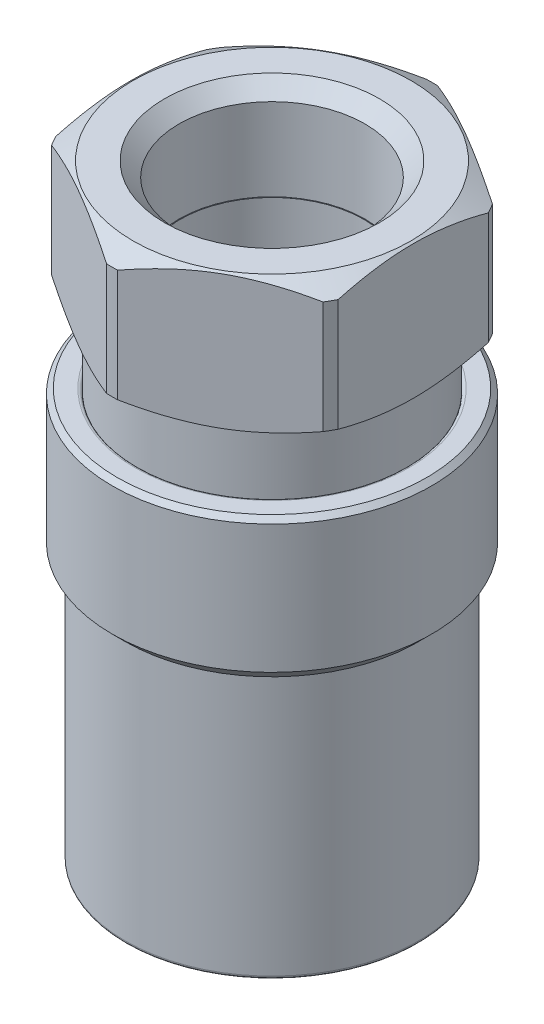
ISO-10303-21;
HEADER;
FILE_DESCRIPTION(('STEP AP214'),'2;1');
FILE_NAME('part.step','',(''),(''),'','','');
FILE_SCHEMA(('AUTOMOTIVE_DESIGN { 1 0 10303 214 1 1 1 1 }'));
ENDSEC;
DATA;
#1=APPLICATION_CONTEXT('core data for automotive mechanical design processes');
#2=APPLICATION_PROTOCOL_DEFINITION('international standard','automotive_design',2000,#1);
#3=PRODUCT_CONTEXT('',#1,'mechanical');
#4=PRODUCT('Part','Part','',(#3));
#5=PRODUCT_RELATED_PRODUCT_CATEGORY('part','',(#4));
#6=PRODUCT_DEFINITION_FORMATION('','',#4);
#7=PRODUCT_DEFINITION_CONTEXT('part definition',#1,'design');
#8=PRODUCT_DEFINITION('design','',#6,#7);
#9=PRODUCT_DEFINITION_SHAPE('','',#8);
#10=(LENGTH_UNIT() NAMED_UNIT(*) SI_UNIT(.MILLI.,.METRE.));
#11=(NAMED_UNIT(*) PLANE_ANGLE_UNIT() SI_UNIT($,.RADIAN.));
#12=(NAMED_UNIT(*) SI_UNIT($,.STERADIAN.) SOLID_ANGLE_UNIT());
#13=UNCERTAINTY_MEASURE_WITH_UNIT(LENGTH_MEASURE(1.E-05),#10,'distance_accuracy_value','');
#14=(GEOMETRIC_REPRESENTATION_CONTEXT(3) GLOBAL_UNCERTAINTY_ASSIGNED_CONTEXT((#13)) GLOBAL_UNIT_ASSIGNED_CONTEXT((#10,
#11,#12)) REPRESENTATION_CONTEXT('',''));
#15=CARTESIAN_POINT('',(0.,0.,0.));
#16=DIRECTION('',(0.,0.,1.));
#17=DIRECTION('',(1.,0.,0.));
#18=AXIS2_PLACEMENT_3D('',#15,#16,#17);
#19=CARTESIAN_POINT('',(0.,31.9405,0.));
#20=DIRECTION('',(0.,-1.,0.));
#21=DIRECTION('',(0.,0.,-1.));
#22=AXIS2_PLACEMENT_3D('',#19,#20,#21);
#23=CONICAL_SURFACE('',#22,12.3494480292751,0.785398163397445);
#24=CARTESIAN_POINT('',(0.,32.131,0.));
#25=DIRECTION('',(0.,-1.,0.));
#26=DIRECTION('',(0.,0.,-1.));
#27=AXIS2_PLACEMENT_3D('',#24,#25,#26);
#28=CIRCLE('',#27,12.1589480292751);
#29=CARTESIAN_POINT('',(0.,32.131,12.1589480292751));
#30=VERTEX_POINT('',#29);
#31=EDGE_CURVE('P0_E11',#30,#30,#28,.T.);
#32=ORIENTED_EDGE('',*,*,#31,.T.);
#33=DIRECTION('',(0.,-0.70710678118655,0.707106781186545));
#34=VECTOR('',#33,1.);
#35=CARTESIAN_POINT('',(0.,31.9405,12.3494480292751));
#36=LINE('',#35,#34);
#37=CARTESIAN_POINT('',(0.,31.75,12.5399480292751));
#38=VERTEX_POINT('',#37);
#39=EDGE_CURVE('P0_E27',#30,#38,#36,.T.);
#40=ORIENTED_EDGE('',*,*,#39,.T.);
#41=CARTESIAN_POINT('',(0.,31.75,0.));
#42=DIRECTION('',(0.,1.,0.));
#43=DIRECTION('',(0.,0.,-1.));
#44=AXIS2_PLACEMENT_3D('',#41,#42,#43);
#45=CIRCLE('',#44,12.5399480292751);
#46=CARTESIAN_POINT('',(0.,31.75,-12.5399480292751));
#47=VERTEX_POINT('',#46);
#48=EDGE_CURVE('P0_E250',#38,#47,#45,.T.);
#49=ORIENTED_EDGE('',*,*,#48,.T.);
#50=CARTESIAN_POINT('',(0.,31.75,0.));
#51=DIRECTION('',(0.,1.,0.));
#52=DIRECTION('',(0.,0.,-1.));
#53=AXIS2_PLACEMENT_3D('',#50,#51,#52);
#54=CIRCLE('',#53,12.5399480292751);
#55=EDGE_CURVE('P0_E212',#47,#38,#54,.T.);
#56=ORIENTED_EDGE('',*,*,#55,.T.);
#57=ORIENTED_EDGE('',*,*,#39,.F.);
#58=EDGE_LOOP('',(#32,#40,#49,#56,#57));
#59=FACE_BOUND('',#58,.T.);
#60=ADVANCED_FACE('P0_F16',(#59),#23,.T.);
#61=CARTESIAN_POINT('',(0.,32.131,10.541));
#62=DIRECTION('',(0.,1.,0.));
#63=DIRECTION('',(1.,0.,0.));
#64=AXIS2_PLACEMENT_3D('',#61,#62,#63);
#65=PLANE('',#64);
#66=ORIENTED_EDGE('',*,*,#31,.F.);
#67=EDGE_LOOP('',(#66));
#68=FACE_BOUND('',#67,.T.);
#69=CARTESIAN_POINT('',(0.,32.131,0.));
#70=DIRECTION('',(0.,1.,0.));
#71=DIRECTION('',(0.,0.,-1.));
#72=AXIS2_PLACEMENT_3D('',#69,#70,#71);
#73=CIRCLE('',#72,10.795);
#74=CARTESIAN_POINT('',(0.,32.131,10.795));
#75=VERTEX_POINT('',#74);
#76=CARTESIAN_POINT('',(0.,32.131,-10.795));
#77=VERTEX_POINT('',#76);
#78=EDGE_CURVE('P0_E225',#75,#77,#73,.T.);
#79=ORIENTED_EDGE('',*,*,#78,.F.);
#80=CARTESIAN_POINT('',(0.,32.131,0.));
#81=DIRECTION('',(0.,1.,0.));
#82=DIRECTION('',(0.,0.,-1.));
#83=AXIS2_PLACEMENT_3D('',#80,#81,#82);
#84=CIRCLE('',#83,10.795);
#85=EDGE_CURVE('P0_E220',#77,#75,#84,.T.);
#86=ORIENTED_EDGE('',*,*,#85,.F.);
#87=EDGE_LOOP('',(#79,#86));
#88=FACE_BOUND('',#87,.T.);
#89=ADVANCED_FACE('P0_F431',(#68,#88),#65,.T.);
#90=CARTESIAN_POINT('',(0.,26.8947740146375,0.));
#91=DIRECTION('',(0.,1.,0.));
#92=DIRECTION('',(0.,0.,1.));
#93=AXIS2_PLACEMENT_3D('',#90,#91,#92);
#94=CYLINDRICAL_SURFACE('',#93,12.5399480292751);
#95=ORIENTED_EDGE('',*,*,#48,.F.);
#96=ORIENTED_EDGE('',*,*,#55,.F.);
#97=DIRECTION('',(0.,-1.,0.));
#98=VECTOR('',#97,1.);
#99=CARTESIAN_POINT('',(0.,26.8947740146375,-12.5399480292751));
#100=LINE('',#99,#98);
#101=CARTESIAN_POINT('',(0.,21.6585480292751,-12.5399480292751));
#102=VERTEX_POINT('',#101);
#103=EDGE_CURVE('P0_E209',#47,#102,#100,.T.);
#104=ORIENTED_EDGE('',*,*,#103,.T.);
#105=CARTESIAN_POINT('',(0.,21.6585480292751,0.));
#106=DIRECTION('',(0.,1.,0.));
#107=DIRECTION('',(1.,0.,0.));
#108=AXIS2_PLACEMENT_3D('',#105,#106,#107);
#109=CIRCLE('',#108,12.5399480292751);
#110=CARTESIAN_POINT('',(0.,21.6585480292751,12.5399480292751));
#111=VERTEX_POINT('',#110);
#112=EDGE_CURVE('P0_E213',#102,#111,#109,.T.);
#113=ORIENTED_EDGE('',*,*,#112,.T.);
#114=CARTESIAN_POINT('',(0.,21.6585480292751,0.));
#115=DIRECTION('',(0.,1.,0.));
#116=DIRECTION('',(1.,0.,0.));
#117=AXIS2_PLACEMENT_3D('',#114,#115,#116);
#118=CIRCLE('',#117,12.5399480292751);
#119=EDGE_CURVE('P0_E276',#111,#102,#118,.T.);
#120=ORIENTED_EDGE('',*,*,#119,.T.);
#121=ORIENTED_EDGE('',*,*,#103,.F.);
#122=EDGE_LOOP('',(#95,#96,#104,#113,#120,#121));
#123=FACE_BOUND('',#122,.T.);
#124=ADVANCED_FACE('P0_F438',(#123),#94,.T.);
#125=CARTESIAN_POINT('',(0.,0.254,0.));
#126=DIRECTION('',(0.,1.,0.));
#127=DIRECTION('',(0.,0.,1.));
#128=AXIS2_PLACEMENT_3D('',#125,#126,#127);
#129=TOROIDAL_SURFACE('',#128,11.2522,0.254);
#130=CARTESIAN_POINT('',(0.,0.254,0.));
#131=DIRECTION('',(0.,-1.,0.));
#132=DIRECTION('',(0.,0.,-1.));
#133=AXIS2_PLACEMENT_3D('',#130,#131,#132);
#134=CIRCLE('',#133,11.5062);
#135=CARTESIAN_POINT('',(0.,0.254,11.5062));
#136=VERTEX_POINT('',#135);
#137=CARTESIAN_POINT('',(0.,0.254,-11.5062));
#138=VERTEX_POINT('',#137);
#139=EDGE_CURVE('P0_E20',#136,#138,#134,.T.);
#140=ORIENTED_EDGE('',*,*,#139,.T.);
#141=CARTESIAN_POINT('',(0.,0.254,-11.2522));
#142=DIRECTION('',(-1.,0.,0.));
#143=DIRECTION('',(0.,0.,-1.));
#144=AXIS2_PLACEMENT_3D('',#141,#142,#143);
#145=CIRCLE('',#144,0.254);
#146=CARTESIAN_POINT('',(0.,0.,-11.2522));
#147=VERTEX_POINT('',#146);
#148=EDGE_CURVE('P0_E215',#138,#147,#145,.T.);
#149=ORIENTED_EDGE('',*,*,#148,.T.);
#150=CARTESIAN_POINT('',(0.,0.,0.));
#151=DIRECTION('',(0.,1.,0.));
#152=DIRECTION('',(0.,0.,-1.));
#153=AXIS2_PLACEMENT_3D('',#150,#151,#152);
#154=CIRCLE('',#153,11.2522);
#155=CARTESIAN_POINT('',(0.,0.,11.2522));
#156=VERTEX_POINT('',#155);
#157=EDGE_CURVE('P0_E219',#147,#156,#154,.T.);
#158=ORIENTED_EDGE('',*,*,#157,.T.);
#159=CARTESIAN_POINT('',(0.,0.,0.));
#160=DIRECTION('',(0.,1.,0.));
#161=DIRECTION('',(0.,0.,-1.));
#162=AXIS2_PLACEMENT_3D('',#159,#160,#161);
#163=CIRCLE('',#162,11.2522);
#164=EDGE_CURVE('P0_E293',#156,#147,#163,.T.);
#165=ORIENTED_EDGE('',*,*,#164,.T.);
#166=ORIENTED_EDGE('',*,*,#148,.F.);
#167=CARTESIAN_POINT('',(0.,0.254,0.));
#168=DIRECTION('',(0.,-1.,0.));
#169=DIRECTION('',(0.,0.,-1.));
#170=AXIS2_PLACEMENT_3D('',#167,#168,#169);
#171=CIRCLE('',#170,11.5062);
#172=EDGE_CURVE('P0_E260',#138,#136,#171,.T.);
#173=ORIENTED_EDGE('',*,*,#172,.T.);
#174=EDGE_LOOP('',(#140,#149,#158,#165,#166,#173));
#175=FACE_BOUND('',#174,.T.);
#176=ADVANCED_FACE('P0_F326',(#175),#129,.T.);
#177=CARTESIAN_POINT('',(0.,0.,11.5062));
#178=DIRECTION('',(0.,-1.,0.));
#179=DIRECTION('',(0.,0.,-1.));
#180=AXIS2_PLACEMENT_3D('',#177,#178,#179);
#181=PLANE('',#180);
#182=ORIENTED_EDGE('',*,*,#164,.F.);
#183=ORIENTED_EDGE('',*,*,#157,.F.);
#184=EDGE_LOOP('',(#182,#183));
#185=FACE_BOUND('',#184,.T.);
#186=CARTESIAN_POINT('',(0.,0.,0.));
#187=DIRECTION('',(0.,-1.,0.));
#188=DIRECTION('',(0.,0.,-1.));
#189=AXIS2_PLACEMENT_3D('',#186,#187,#188);
#190=CIRCLE('',#189,10.3124003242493);
#191=CARTESIAN_POINT('',(0.,0.,10.3124003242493));
#192=VERTEX_POINT('',#191);
#193=CARTESIAN_POINT('',(0.,0.,-10.3124003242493));
#194=VERTEX_POINT('',#193);
#195=EDGE_CURVE('P0_E229',#192,#194,#190,.T.);
#196=ORIENTED_EDGE('',*,*,#195,.F.);
#197=CARTESIAN_POINT('',(0.,0.,0.));
#198=DIRECTION('',(0.,-1.,0.));
#199=DIRECTION('',(0.,0.,-1.));
#200=AXIS2_PLACEMENT_3D('',#197,#198,#199);
#201=CIRCLE('',#200,10.3124003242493);
#202=EDGE_CURVE('P0_E304',#194,#192,#201,.T.);
#203=ORIENTED_EDGE('',*,*,#202,.F.);
#204=EDGE_LOOP('',(#196,#203));
#205=FACE_BOUND('',#204,.T.);
#206=ADVANCED_FACE('P0_F346',(#185,#205),#181,.T.);
#207=CARTESIAN_POINT('',(0.,10.3124,0.));
#208=DIRECTION('',(0.,1.,0.));
#209=DIRECTION('',(0.,0.,1.));
#210=AXIS2_PLACEMENT_3D('',#207,#208,#209);
#211=CYLINDRICAL_SURFACE('',#210,11.5062);
#212=CARTESIAN_POINT('',(0.,20.6248,0.));
#213=DIRECTION('',(0.,1.,0.));
#214=DIRECTION('',(1.,0.,0.));
#215=AXIS2_PLACEMENT_3D('',#212,#213,#214);
#216=CIRCLE('',#215,11.5062);
#217=CARTESIAN_POINT('',(0.,20.6248,11.5062));
#218=VERTEX_POINT('',#217);
#219=CARTESIAN_POINT('',(0.,20.6248,-11.5062));
#220=VERTEX_POINT('',#219);
#221=EDGE_CURVE('P0_E230',#218,#220,#216,.T.);
#222=ORIENTED_EDGE('',*,*,#221,.F.);
#223=CARTESIAN_POINT('',(0.,20.6248,0.));
#224=DIRECTION('',(0.,1.,0.));
#225=DIRECTION('',(1.,0.,0.));
#226=AXIS2_PLACEMENT_3D('',#223,#224,#225);
#227=CIRCLE('',#226,11.5062);
#228=EDGE_CURVE('P0_E232',#220,#218,#227,.T.);
#229=ORIENTED_EDGE('',*,*,#228,.F.);
#230=DIRECTION('',(0.,-1.,0.));
#231=VECTOR('',#230,1.);
#232=CARTESIAN_POINT('',(0.,10.3124,-11.5062));
#233=LINE('',#232,#231);
#234=EDGE_CURVE('P0_E257',#220,#138,#233,.T.);
#235=ORIENTED_EDGE('',*,*,#234,.T.);
#236=ORIENTED_EDGE('',*,*,#139,.F.);
#237=ORIENTED_EDGE('',*,*,#172,.F.);
#238=ORIENTED_EDGE('',*,*,#234,.F.);
#239=EDGE_LOOP('',(#222,#229,#235,#236,#237,#238));
#240=FACE_BOUND('',#239,.T.);
#241=ADVANCED_FACE('P0_F331',(#240),#211,.T.);
#242=CARTESIAN_POINT('',(0.,31.877,0.));
#243=DIRECTION('',(0.,1.,0.));
#244=DIRECTION('',(0.,0.,1.));
#245=AXIS2_PLACEMENT_3D('',#242,#243,#244);
#246=TOROIDAL_SURFACE('',#245,10.795,0.254);
#247=CARTESIAN_POINT('',(0.,31.877,0.));
#248=DIRECTION('',(0.,-1.,0.));
#249=DIRECTION('',(0.,0.,-1.));
#250=AXIS2_PLACEMENT_3D('',#247,#248,#249);
#251=CIRCLE('',#250,10.541);
#252=CARTESIAN_POINT('',(0.,31.877,10.541));
#253=VERTEX_POINT('',#252);
#254=CARTESIAN_POINT('',(0.,31.877,-10.541));
#255=VERTEX_POINT('',#254);
#256=EDGE_CURVE('P0_E261',#253,#255,#251,.T.);
#257=ORIENTED_EDGE('',*,*,#256,.T.);
#258=CARTESIAN_POINT('',(0.,31.877,-10.795));
#259=DIRECTION('',(-1.,0.,0.));
#260=DIRECTION('',(0.,0.,-1.));
#261=AXIS2_PLACEMENT_3D('',#258,#259,#260);
#262=CIRCLE('',#261,0.254);
#263=EDGE_CURVE('P0_E224',#255,#77,#262,.T.);
#264=ORIENTED_EDGE('',*,*,#263,.T.);
#265=ORIENTED_EDGE('',*,*,#85,.T.);
#266=ORIENTED_EDGE('',*,*,#78,.T.);
#267=ORIENTED_EDGE('',*,*,#263,.F.);
#268=CARTESIAN_POINT('',(0.,31.877,0.));
#269=DIRECTION('',(0.,-1.,0.));
#270=DIRECTION('',(0.,0.,-1.));
#271=AXIS2_PLACEMENT_3D('',#268,#269,#270);
#272=CIRCLE('',#271,10.541);
#273=EDGE_CURVE('P0_E299',#255,#253,#272,.T.);
#274=ORIENTED_EDGE('',*,*,#273,.T.);
#275=EDGE_LOOP('',(#257,#264,#265,#266,#267,#274));
#276=FACE_BOUND('',#275,.T.);
#277=ADVANCED_FACE('P0_F445',(#276),#246,.T.);
#278=CARTESIAN_POINT('',(0.,19.3675,0.));
#279=DIRECTION('',(0.,1.,0.));
#280=DIRECTION('',(0.,0.,1.));
#281=AXIS2_PLACEMENT_3D('',#278,#279,#280);
#282=CYLINDRICAL_SURFACE('',#281,10.541);
#283=ORIENTED_EDGE('',*,*,#256,.F.);
#284=ORIENTED_EDGE('',*,*,#273,.F.);
#285=DIRECTION('',(0.,-1.,0.));
#286=VECTOR('',#285,1.);
#287=CARTESIAN_POINT('',(0.,19.3675,-10.541));
#288=LINE('',#287,#286);
#289=CARTESIAN_POINT('',(0.,7.366,-10.541));
#290=VERTEX_POINT('',#289);
#291=EDGE_CURVE('P0_E170',#255,#290,#288,.T.);
#292=ORIENTED_EDGE('',*,*,#291,.T.);
#293=CARTESIAN_POINT('',(0.,7.366,0.));
#294=DIRECTION('',(0.,1.,0.));
#295=DIRECTION('',(0.,0.,-1.));
#296=AXIS2_PLACEMENT_3D('',#293,#294,#295);
#297=CIRCLE('',#296,10.541);
#298=CARTESIAN_POINT('',(0.,7.366,10.541));
#299=VERTEX_POINT('',#298);
#300=EDGE_CURVE('P0_E165',#299,#290,#297,.T.);
#301=ORIENTED_EDGE('',*,*,#300,.F.);
#302=CARTESIAN_POINT('',(0.,7.366,0.));
#303=DIRECTION('',(0.,1.,0.));
#304=DIRECTION('',(0.,0.,-1.));
#305=AXIS2_PLACEMENT_3D('',#302,#303,#304);
#306=CIRCLE('',#305,10.541);
#307=EDGE_CURVE('P0_E169',#290,#299,#306,.T.);
#308=ORIENTED_EDGE('',*,*,#307,.F.);
#309=ORIENTED_EDGE('',*,*,#291,.F.);
#310=EDGE_LOOP('',(#283,#284,#292,#301,#308,#309));
#311=FACE_BOUND('',#310,.T.);
#312=ADVANCED_FACE('P0_F167',(#311),#282,.F.);
#313=CARTESIAN_POINT('',(0.,7.366,0.));
#314=DIRECTION('',(0.,1.,0.));
#315=DIRECTION('',(0.,0.,1.));
#316=AXIS2_PLACEMENT_3D('',#313,#314,#315);
#317=TOROIDAL_SURFACE('',#316,9.779,0.762);
#318=ORIENTED_EDGE('',*,*,#300,.T.);
#319=CARTESIAN_POINT('',(0.,7.366,-9.779));
#320=DIRECTION('',(-1.,0.,0.));
#321=DIRECTION('',(0.,0.,-1.));
#322=AXIS2_PLACEMENT_3D('',#319,#320,#321);
#323=CIRCLE('',#322,0.762);
#324=CARTESIAN_POINT('',(0.,6.604,-9.779));
#325=VERTEX_POINT('',#324);
#326=EDGE_CURVE('P0_E175',#290,#325,#323,.T.);
#327=ORIENTED_EDGE('',*,*,#326,.T.);
#328=CARTESIAN_POINT('',(0.,6.604,0.));
#329=DIRECTION('',(0.,-1.,0.));
#330=DIRECTION('',(0.,0.,-1.));
#331=AXIS2_PLACEMENT_3D('',#328,#329,#330);
#332=CIRCLE('',#331,9.779);
#333=CARTESIAN_POINT('',(0.,6.604,9.779));
#334=VERTEX_POINT('',#333);
#335=EDGE_CURVE('P0_E188',#325,#334,#332,.T.);
#336=ORIENTED_EDGE('',*,*,#335,.T.);
#337=CARTESIAN_POINT('',(0.,6.604,0.));
#338=DIRECTION('',(0.,-1.,0.));
#339=DIRECTION('',(0.,0.,-1.));
#340=AXIS2_PLACEMENT_3D('',#337,#338,#339);
#341=CIRCLE('',#340,9.779);
#342=EDGE_CURVE('P0_E180',#334,#325,#341,.T.);
#343=ORIENTED_EDGE('',*,*,#342,.T.);
#344=ORIENTED_EDGE('',*,*,#326,.F.);
#345=ORIENTED_EDGE('',*,*,#307,.T.);
#346=EDGE_LOOP('',(#318,#327,#336,#343,#344,#345));
#347=FACE_BOUND('',#346,.T.);
#348=ADVANCED_FACE('P0_F177',(#347),#317,.F.);
#349=CARTESIAN_POINT('',(0.,6.604,9.017));
#350=DIRECTION('',(0.,1.,0.));
#351=DIRECTION('',(1.,0.,0.));
#352=AXIS2_PLACEMENT_3D('',#349,#350,#351);
#353=PLANE('',#352);
#354=ORIENTED_EDGE('',*,*,#342,.F.);
#355=ORIENTED_EDGE('',*,*,#335,.F.);
#356=EDGE_LOOP('',(#354,#355));
#357=FACE_BOUND('',#356,.T.);
#358=CARTESIAN_POINT('',(0.,6.604,0.));
#359=DIRECTION('',(0.,1.,0.));
#360=DIRECTION('',(0.,0.,-1.));
#361=AXIS2_PLACEMENT_3D('',#358,#359,#360);
#362=CIRCLE('',#361,9.398);
#363=CARTESIAN_POINT('',(0.,6.604,9.398));
#364=VERTEX_POINT('',#363);
#365=CARTESIAN_POINT('',(0.,6.604,-9.398));
#366=VERTEX_POINT('',#365);
#367=EDGE_CURVE('P0_E283',#364,#366,#362,.T.);
#368=ORIENTED_EDGE('',*,*,#367,.F.);
#369=CARTESIAN_POINT('',(0.,6.604,0.));
#370=DIRECTION('',(0.,1.,0.));
#371=DIRECTION('',(0.,0.,-1.));
#372=AXIS2_PLACEMENT_3D('',#369,#370,#371);
#373=CIRCLE('',#372,9.398);
#374=EDGE_CURVE('P0_E385',#366,#364,#373,.T.);
#375=ORIENTED_EDGE('',*,*,#374,.F.);
#376=EDGE_LOOP('',(#368,#375));
#377=FACE_BOUND('',#376,.T.);
#378=ADVANCED_FACE('P0_F415',(#357,#377),#353,.T.);
#379=CARTESIAN_POINT('',(0.,2.61800544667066,0.));
#380=DIRECTION('',(0.,1.,0.));
#381=DIRECTION('',(0.,0.,1.));
#382=AXIS2_PLACEMENT_3D('',#379,#380,#381);
#383=TOROIDAL_SURFACE('',#382,9.144,0.127);
#384=CARTESIAN_POINT('',(0.,2.52820288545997,0.));
#385=DIRECTION('',(0.,-1.,0.));
#386=DIRECTION('',(0.,0.,-1.));
#387=AXIS2_PLACEMENT_3D('',#384,#385,#386);
#388=CIRCLE('',#387,9.0541974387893);
#389=CARTESIAN_POINT('',(0.,2.52820288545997,9.0541974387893));
#390=VERTEX_POINT('',#389);
#391=CARTESIAN_POINT('',(0.,2.52820288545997,-9.0541974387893));
#392=VERTEX_POINT('',#391);
#393=EDGE_CURVE('P0_E181',#390,#392,#388,.T.);
#394=ORIENTED_EDGE('',*,*,#393,.T.);
#395=CARTESIAN_POINT('',(0.,2.61800544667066,-9.144));
#396=DIRECTION('',(-1.,0.,0.));
#397=DIRECTION('',(0.,0.,-1.));
#398=AXIS2_PLACEMENT_3D('',#395,#396,#397);
#399=CIRCLE('',#398,0.127);
#400=CARTESIAN_POINT('',(0.,2.61800544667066,-9.017));
#401=VERTEX_POINT('',#400);
#402=EDGE_CURVE('P0_E191',#392,#401,#399,.T.);
#403=ORIENTED_EDGE('',*,*,#402,.T.);
#404=CARTESIAN_POINT('',(0.,2.61800544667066,0.));
#405=DIRECTION('',(0.,1.,0.));
#406=DIRECTION('',(0.,0.,-1.));
#407=AXIS2_PLACEMENT_3D('',#404,#405,#406);
#408=CIRCLE('',#407,9.017);
#409=CARTESIAN_POINT('',(0.,2.61800544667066,9.017));
#410=VERTEX_POINT('',#409);
#411=EDGE_CURVE('P0_E206',#401,#410,#408,.T.);
#412=ORIENTED_EDGE('',*,*,#411,.T.);
#413=CARTESIAN_POINT('',(0.,2.61800544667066,0.));
#414=DIRECTION('',(0.,1.,0.));
#415=DIRECTION('',(0.,0.,-1.));
#416=AXIS2_PLACEMENT_3D('',#413,#414,#415);
#417=CIRCLE('',#416,9.017);
#418=EDGE_CURVE('P0_E236',#410,#401,#417,.T.);
#419=ORIENTED_EDGE('',*,*,#418,.T.);
#420=ORIENTED_EDGE('',*,*,#402,.F.);
#421=CARTESIAN_POINT('',(0.,2.52820288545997,0.));
#422=DIRECTION('',(0.,-1.,0.));
#423=DIRECTION('',(0.,0.,-1.));
#424=AXIS2_PLACEMENT_3D('',#421,#422,#423);
#425=CIRCLE('',#424,9.0541974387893);
#426=EDGE_CURVE('P0_E239',#392,#390,#425,.T.);
#427=ORIENTED_EDGE('',*,*,#426,.T.);
#428=EDGE_LOOP('',(#394,#403,#412,#419,#420,#427));
#429=FACE_BOUND('',#428,.T.);
#430=ADVANCED_FACE('P0_F417',(#429),#383,.T.);
#431=CARTESIAN_POINT('',(0.,1.99390016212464,0.));
#432=DIRECTION('',(0.,-1.,0.));
#433=DIRECTION('',(0.,0.,1.));
#434=AXIS2_PLACEMENT_3D('',#431,#432,#433);
#435=CONICAL_SURFACE('',#434,9.58850016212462,0.785398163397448);
#436=ORIENTED_EDGE('',*,*,#393,.F.);
#437=ORIENTED_EDGE('',*,*,#426,.F.);
#438=DIRECTION('',(0.,-0.707106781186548,-0.707106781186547));
#439=VECTOR('',#438,1.);
#440=CARTESIAN_POINT('',(0.,1.99390016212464,-9.58850016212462));
#441=LINE('',#440,#439);
#442=CARTESIAN_POINT('',(0.,1.64558463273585,-9.93681569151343));
#443=VERTEX_POINT('',#442);
#444=EDGE_CURVE('P0_E368',#392,#443,#441,.T.);
#445=ORIENTED_EDGE('',*,*,#444,.T.);
#446=CARTESIAN_POINT('',(0.,1.64558463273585,0.));
#447=DIRECTION('',(0.,1.,0.));
#448=DIRECTION('',(0.,0.,-1.));
#449=AXIS2_PLACEMENT_3D('',#446,#447,#448);
#450=CIRCLE('',#449,9.93681569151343);
#451=CARTESIAN_POINT('',(0.,1.64558463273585,9.93681569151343));
#452=VERTEX_POINT('',#451);
#453=EDGE_CURVE('P0_E244',#452,#443,#450,.T.);
#454=ORIENTED_EDGE('',*,*,#453,.F.);
#455=CARTESIAN_POINT('',(0.,1.64558463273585,0.));
#456=DIRECTION('',(0.,1.,0.));
#457=DIRECTION('',(0.,0.,-1.));
#458=AXIS2_PLACEMENT_3D('',#455,#456,#457);
#459=CIRCLE('',#458,9.93681569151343);
#460=EDGE_CURVE('P0_E197',#443,#452,#459,.T.);
#461=ORIENTED_EDGE('',*,*,#460,.F.);
#462=ORIENTED_EDGE('',*,*,#444,.F.);
#463=EDGE_LOOP('',(#436,#437,#445,#454,#461,#462));
#464=FACE_BOUND('',#463,.T.);
#465=ADVANCED_FACE('P0_F367',(#464),#435,.F.);
#466=CARTESIAN_POINT('',(0.,4.58470016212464,0.));
#467=DIRECTION('',(0.,1.,0.));
#468=DIRECTION('',(0.,0.,1.));
#469=AXIS2_PLACEMENT_3D('',#466,#467,#468);
#470=CYLINDRICAL_SURFACE('',#469,9.017);
#471=CARTESIAN_POINT('',(0.,6.223,0.));
#472=DIRECTION('',(0.,-1.,0.));
#473=DIRECTION('',(0.,0.,-1.));
#474=AXIS2_PLACEMENT_3D('',#471,#472,#473);
#475=CIRCLE('',#474,9.017);
#476=CARTESIAN_POINT('',(0.,6.223,9.017));
#477=VERTEX_POINT('',#476);
#478=CARTESIAN_POINT('',(0.,6.223,-9.017));
#479=VERTEX_POINT('',#478);
#480=EDGE_CURVE('P0_E300',#477,#479,#475,.T.);
#481=ORIENTED_EDGE('',*,*,#480,.F.);
#482=CARTESIAN_POINT('',(0.,6.223,0.));
#483=DIRECTION('',(0.,-1.,0.));
#484=DIRECTION('',(0.,0.,-1.));
#485=AXIS2_PLACEMENT_3D('',#482,#483,#484);
#486=CIRCLE('',#485,9.017);
#487=EDGE_CURVE('P0_E249',#479,#477,#486,.T.);
#488=ORIENTED_EDGE('',*,*,#487,.F.);
#489=DIRECTION('',(0.,-1.,0.));
#490=VECTOR('',#489,1.);
#491=CARTESIAN_POINT('',(0.,4.58470016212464,-9.017));
#492=LINE('',#491,#490);
#493=EDGE_CURVE('P0_E370',#479,#401,#492,.T.);
#494=ORIENTED_EDGE('',*,*,#493,.T.);
#495=ORIENTED_EDGE('',*,*,#418,.F.);
#496=ORIENTED_EDGE('',*,*,#411,.F.);
#497=ORIENTED_EDGE('',*,*,#493,.F.);
#498=EDGE_LOOP('',(#481,#488,#494,#495,#496,#497));
#499=FACE_BOUND('',#498,.T.);
#500=ADVANCED_FACE('P0_F471',(#499),#470,.F.);
#501=CARTESIAN_POINT('',(0.,1.1067692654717,0.));
#502=DIRECTION('',(0.,1.,0.));
#503=DIRECTION('',(0.,0.,1.));
#504=AXIS2_PLACEMENT_3D('',#501,#502,#503);
#505=TOROIDAL_SURFACE('',#504,9.39800032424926,0.762);
#506=ORIENTED_EDGE('',*,*,#453,.T.);
#507=CARTESIAN_POINT('',(0.,1.1067692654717,-9.39800032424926));
#508=DIRECTION('',(-1.,0.,0.));
#509=DIRECTION('',(0.,0.,-1.));
#510=AXIS2_PLACEMENT_3D('',#507,#508,#509);
#511=CIRCLE('',#510,0.762);
#512=CARTESIAN_POINT('',(0.,1.1067692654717,-10.1600003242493));
#513=VERTEX_POINT('',#512);
#514=EDGE_CURVE('P0_E240',#443,#513,#511,.T.);
#515=ORIENTED_EDGE('',*,*,#514,.T.);
#516=CARTESIAN_POINT('',(0.,1.1067692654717,0.));
#517=DIRECTION('',(0.,-1.,0.));
#518=DIRECTION('',(0.,0.,-1.));
#519=AXIS2_PLACEMENT_3D('',#516,#517,#518);
#520=CIRCLE('',#519,10.1600003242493);
#521=CARTESIAN_POINT('',(0.,1.1067692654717,10.1600003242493));
#522=VERTEX_POINT('',#521);
#523=EDGE_CURVE('P0_E194',#513,#522,#520,.T.);
#524=ORIENTED_EDGE('',*,*,#523,.T.);
#525=CARTESIAN_POINT('',(0.,1.1067692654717,0.));
#526=DIRECTION('',(0.,-1.,0.));
#527=DIRECTION('',(0.,0.,-1.));
#528=AXIS2_PLACEMENT_3D('',#525,#526,#527);
#529=CIRCLE('',#528,10.1600003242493);
#530=EDGE_CURVE('P0_E201',#522,#513,#529,.T.);
#531=ORIENTED_EDGE('',*,*,#530,.T.);
#532=ORIENTED_EDGE('',*,*,#514,.F.);
#533=ORIENTED_EDGE('',*,*,#460,.T.);
#534=EDGE_LOOP('',(#506,#515,#524,#531,#532,#533));
#535=FACE_BOUND('',#534,.T.);
#536=ADVANCED_FACE('P0_F18',(#535),#505,.F.);
#537=CARTESIAN_POINT('',(0.,0.7112,0.));
#538=DIRECTION('',(0.,1.,0.));
#539=DIRECTION('',(0.,0.,1.));
#540=AXIS2_PLACEMENT_3D('',#537,#538,#539);
#541=CYLINDRICAL_SURFACE('',#540,10.1600003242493);
#542=ORIENTED_EDGE('',*,*,#530,.F.);
#543=ORIENTED_EDGE('',*,*,#523,.F.);
#544=DIRECTION('',(0.,-1.,0.));
#545=VECTOR('',#544,1.);
#546=CARTESIAN_POINT('',(0.,0.7112,-10.1600003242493));
#547=LINE('',#546,#545);
#548=CARTESIAN_POINT('',(0.,0.1524,-10.1600003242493));
#549=VERTEX_POINT('',#548);
#550=EDGE_CURVE('P0_E202',#513,#549,#547,.T.);
#551=ORIENTED_EDGE('',*,*,#550,.T.);
#552=CARTESIAN_POINT('',(0.,0.1524,0.));
#553=DIRECTION('',(0.,1.,0.));
#554=DIRECTION('',(0.,0.,-1.));
#555=AXIS2_PLACEMENT_3D('',#552,#553,#554);
#556=CIRCLE('',#555,10.1600003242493);
#557=CARTESIAN_POINT('',(0.,0.1524,10.1600003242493));
#558=VERTEX_POINT('',#557);
#559=EDGE_CURVE('P0_E289',#558,#549,#556,.T.);
#560=ORIENTED_EDGE('',*,*,#559,.F.);
#561=CARTESIAN_POINT('',(0.,0.1524,0.));
#562=DIRECTION('',(0.,1.,0.));
#563=DIRECTION('',(0.,0.,-1.));
#564=AXIS2_PLACEMENT_3D('',#561,#562,#563);
#565=CIRCLE('',#564,10.1600003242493);
#566=EDGE_CURVE('P0_E284',#549,#558,#565,.T.);
#567=ORIENTED_EDGE('',*,*,#566,.F.);
#568=ORIENTED_EDGE('',*,*,#550,.F.);
#569=EDGE_LOOP('',(#542,#543,#551,#560,#567,#568));
#570=FACE_BOUND('',#569,.T.);
#571=ADVANCED_FACE('P0_F358',(#570),#541,.F.);
#572=CARTESIAN_POINT('',(0.,0.1524,0.));
#573=DIRECTION('',(0.,1.,0.));
#574=DIRECTION('',(0.,0.,1.));
#575=AXIS2_PLACEMENT_3D('',#572,#573,#574);
#576=TOROIDAL_SURFACE('',#575,10.3124003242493,0.1524);
#577=ORIENTED_EDGE('',*,*,#195,.T.);
#578=CARTESIAN_POINT('',(0.,0.1524,-10.3124003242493));
#579=DIRECTION('',(-1.,0.,0.));
#580=DIRECTION('',(0.,0.,-1.));
#581=AXIS2_PLACEMENT_3D('',#578,#579,#580);
#582=CIRCLE('',#581,0.1524);
#583=EDGE_CURVE('P0_E288',#194,#549,#582,.T.);
#584=ORIENTED_EDGE('',*,*,#583,.T.);
#585=ORIENTED_EDGE('',*,*,#566,.T.);
#586=ORIENTED_EDGE('',*,*,#559,.T.);
#587=ORIENTED_EDGE('',*,*,#583,.F.);
#588=ORIENTED_EDGE('',*,*,#202,.T.);
#589=EDGE_LOOP('',(#577,#584,#585,#586,#587,#588));
#590=FACE_BOUND('',#589,.T.);
#591=ADVANCED_FACE('P0_F351',(#590),#576,.T.);
#592=CARTESIAN_POINT('',(0.,6.223,0.));
#593=DIRECTION('',(0.,1.,0.));
#594=DIRECTION('',(0.,0.,1.));
#595=AXIS2_PLACEMENT_3D('',#592,#593,#594);
#596=TOROIDAL_SURFACE('',#595,9.398,0.381);
#597=ORIENTED_EDGE('',*,*,#480,.T.);
#598=CARTESIAN_POINT('',(0.,6.223,-9.398));
#599=DIRECTION('',(-1.,0.,0.));
#600=DIRECTION('',(0.,0.,-1.));
#601=AXIS2_PLACEMENT_3D('',#598,#599,#600);
#602=CIRCLE('',#601,0.381);
#603=EDGE_CURVE('P0_E305',#479,#366,#602,.T.);
#604=ORIENTED_EDGE('',*,*,#603,.T.);
#605=ORIENTED_EDGE('',*,*,#374,.T.);
#606=ORIENTED_EDGE('',*,*,#367,.T.);
#607=ORIENTED_EDGE('',*,*,#603,.F.);
#608=ORIENTED_EDGE('',*,*,#487,.T.);
#609=EDGE_LOOP('',(#597,#604,#605,#606,#607,#608));
#610=FACE_BOUND('',#609,.T.);
#611=ADVANCED_FACE('P0_F410',(#610),#596,.T.);
#612=CARTESIAN_POINT('',(0.,21.1416740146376,0.));
#613=DIRECTION('',(0.,1.,0.));
#614=DIRECTION('',(0.,0.,1.));
#615=AXIS2_PLACEMENT_3D('',#612,#613,#614);
#616=CONICAL_SURFACE('',#615,12.0230740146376,0.785398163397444);
#617=ORIENTED_EDGE('',*,*,#119,.F.);
#618=ORIENTED_EDGE('',*,*,#112,.F.);
#619=DIRECTION('',(0.,-0.707106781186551,0.707106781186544));
#620=VECTOR('',#619,1.);
#621=CARTESIAN_POINT('',(0.,21.1416740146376,-12.0230740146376));
#622=LINE('',#621,#620);
#623=EDGE_CURVE('P0_E245',#102,#220,#622,.T.);
#624=ORIENTED_EDGE('',*,*,#623,.T.);
#625=ORIENTED_EDGE('',*,*,#228,.T.);
#626=ORIENTED_EDGE('',*,*,#221,.T.);
#627=ORIENTED_EDGE('',*,*,#623,.F.);
#628=EDGE_LOOP('',(#617,#618,#624,#625,#626,#627));
#629=FACE_BOUND('',#628,.T.);
#630=ADVANCED_FACE('P0_F335',(#629),#616,.T.);
#631=CLOSED_SHELL('',(#60,#89,#124,#176,#206,#241,#277,#312,#348,#378,#430,#465,#500,#536,#571,
#591,#611,#630));
#632=MANIFOLD_SOLID_BREP('P0_B1',#631);
#633=CARTESIAN_POINT('',(0.,47.0535,0.));
#634=DIRECTION('',(0.,1.,0.));
#635=DIRECTION('',(0.,0.,-1.));
#636=AXIS2_PLACEMENT_3D('',#633,#634,#635);
#637=CONICAL_SURFACE('',#636,7.874,0.785398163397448);
#638=CARTESIAN_POINT('',(0.,47.625,0.));
#639=DIRECTION('',(0.,1.,0.));
#640=DIRECTION('',(0.,0.,-1.));
#641=AXIS2_PLACEMENT_3D('',#638,#639,#640);
#642=CIRCLE('',#641,8.4455);
#643=CARTESIAN_POINT('',(0.,47.625,8.4455));
#644=VERTEX_POINT('',#643);
#645=EDGE_CURVE('P1_E11',#644,#644,#642,.T.);
#646=ORIENTED_EDGE('',*,*,#645,.T.);
#647=DIRECTION('',(0.,-0.707106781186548,-0.707106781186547));
#648=VECTOR('',#647,1.);
#649=CARTESIAN_POINT('',(0.,47.0535,7.874));
#650=LINE('',#649,#648);
#651=CARTESIAN_POINT('',(0.,46.482,7.3025));
#652=VERTEX_POINT('',#651);
#653=EDGE_CURVE('P1_E27',#644,#652,#650,.T.);
#654=ORIENTED_EDGE('',*,*,#653,.T.);
#655=CARTESIAN_POINT('',(0.,46.482,0.));
#656=DIRECTION('',(0.,-1.,0.));
#657=DIRECTION('',(0.,0.,-1.));
#658=AXIS2_PLACEMENT_3D('',#655,#656,#657);
#659=CIRCLE('',#658,7.3025);
#660=CARTESIAN_POINT('',(0.,46.482,-7.3025));
#661=VERTEX_POINT('',#660);
#662=EDGE_CURVE('P1_E403',#652,#661,#659,.T.);
#663=ORIENTED_EDGE('',*,*,#662,.T.);
#664=CARTESIAN_POINT('',(0.,46.482,0.));
#665=DIRECTION('',(0.,-1.,0.));
#666=DIRECTION('',(0.,0.,-1.));
#667=AXIS2_PLACEMENT_3D('',#664,#665,#666);
#668=CIRCLE('',#667,7.3025);
#669=EDGE_CURVE('P1_E396',#661,#652,#668,.T.);
#670=ORIENTED_EDGE('',*,*,#669,.T.);
#671=ORIENTED_EDGE('',*,*,#653,.F.);
#672=EDGE_LOOP('',(#646,#654,#663,#670,#671));
#673=FACE_BOUND('',#672,.T.);
#674=ADVANCED_FACE('P1_F16',(#673),#637,.F.);
#675=CARTESIAN_POINT('',(0.,43.815,0.));
#676=DIRECTION('',(0.,-1.,0.));
#677=DIRECTION('',(0.,0.,1.));
#678=AXIS2_PLACEMENT_3D('',#675,#676,#677);
#679=CYLINDRICAL_SURFACE('',#678,7.3025);
#680=ORIENTED_EDGE('',*,*,#662,.F.);
#681=ORIENTED_EDGE('',*,*,#669,.F.);
#682=DIRECTION('',(0.,-1.,0.));
#683=VECTOR('',#682,1.);
#684=CARTESIAN_POINT('',(0.,43.815,-7.3025));
#685=LINE('',#684,#683);
#686=CARTESIAN_POINT('',(0.,40.005,-7.3025));
#687=VERTEX_POINT('',#686);
#688=EDGE_CURVE('P1_E404',#661,#687,#685,.T.);
#689=ORIENTED_EDGE('',*,*,#688,.T.);
#690=CARTESIAN_POINT('',(0.,40.005,0.));
#691=DIRECTION('',(0.,-1.,0.));
#692=DIRECTION('',(0.,0.,1.));
#693=AXIS2_PLACEMENT_3D('',#690,#691,#692);
#694=CIRCLE('',#693,7.3025);
#695=CARTESIAN_POINT('',(0.,40.005,7.3025));
#696=VERTEX_POINT('',#695);
#697=EDGE_CURVE('P1_E418',#687,#696,#694,.T.);
#698=ORIENTED_EDGE('',*,*,#697,.T.);
#699=CARTESIAN_POINT('',(0.,40.005,0.));
#700=DIRECTION('',(0.,-1.,0.));
#701=DIRECTION('',(0.,0.,1.));
#702=AXIS2_PLACEMENT_3D('',#699,#700,#701);
#703=CIRCLE('',#702,7.3025);
#704=EDGE_CURVE('P1_E267',#696,#687,#703,.T.);
#705=ORIENTED_EDGE('',*,*,#704,.T.);
#706=ORIENTED_EDGE('',*,*,#688,.F.);
#707=EDGE_LOOP('',(#680,#681,#689,#698,#705,#706));
#708=FACE_BOUND('',#707,.T.);
#709=ADVANCED_FACE('P1_F770',(#708),#679,.F.);
#710=CARTESIAN_POINT('',(0.,47.625,0.));
#711=DIRECTION('',(0.,1.,0.));
#712=DIRECTION('',(1.,0.,0.));
#713=AXIS2_PLACEMENT_3D('',#710,#711,#712);
#714=PLANE('',#713);
#715=CARTESIAN_POINT('',(0.,47.625,0.));
#716=DIRECTION('',(0.,-1.,0.));
#717=DIRECTION('',(1.,0.,0.));
#718=AXIS2_PLACEMENT_3D('',#715,#716,#717);
#719=CIRCLE('',#718,10.922);
#720=CARTESIAN_POINT('',(-10.922,47.625,0.));
#721=VERTEX_POINT('',#720);
#722=EDGE_CURVE('P1_E362',#721,#721,#719,.T.);
#723=ORIENTED_EDGE('',*,*,#722,.F.);
#724=EDGE_LOOP('',(#723));
#725=FACE_BOUND('',#724,.T.);
#726=ORIENTED_EDGE('',*,*,#645,.F.);
#727=EDGE_LOOP('',(#726));
#728=FACE_BOUND('',#727,.T.);
#729=ADVANCED_FACE('P1_F804',(#725,#728),#714,.T.);
#730=CARTESIAN_POINT('',(0.,33.4257540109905,0.));
#731=DIRECTION('',(0.,1.,0.));
#732=DIRECTION('',(0.,0.,1.));
#733=AXIS2_PLACEMENT_3D('',#730,#731,#732);
#734=CONICAL_SURFACE('',#733,3.6195,1.17809724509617);
#735=CARTESIAN_POINT('',(0.,34.925,0.));
#736=DIRECTION('',(0.,-1.,0.));
#737=DIRECTION('',(0.,0.,1.));
#738=AXIS2_PLACEMENT_3D('',#735,#736,#737);
#739=CIRCLE('',#738,7.239);
#740=CARTESIAN_POINT('',(0.,34.925,7.239));
#741=VERTEX_POINT('',#740);
#742=CARTESIAN_POINT('',(0.,34.925,-7.239));
#743=VERTEX_POINT('',#742);
#744=EDGE_CURVE('P1_E325',#741,#743,#739,.T.);
#745=ORIENTED_EDGE('',*,*,#744,.F.);
#746=CARTESIAN_POINT('',(0.,34.925,0.));
#747=DIRECTION('',(0.,-1.,0.));
#748=DIRECTION('',(0.,0.,1.));
#749=AXIS2_PLACEMENT_3D('',#746,#747,#748);
#750=CIRCLE('',#749,7.239);
#751=EDGE_CURVE('P1_E273',#743,#741,#750,.T.);
#752=ORIENTED_EDGE('',*,*,#751,.F.);
#753=DIRECTION('',(0.,-0.38268343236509,0.923879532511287));
#754=VECTOR('',#753,1.);
#755=CARTESIAN_POINT('',(0.,33.4257540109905,-3.6195));
#756=LINE('',#755,#754);
#757=CARTESIAN_POINT('',(0.,34.0622759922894,-5.1562));
#758=VERTEX_POINT('',#757);
#759=EDGE_CURVE('P1_E260',#743,#758,#756,.T.);
#760=ORIENTED_EDGE('',*,*,#759,.T.);
#761=CARTESIAN_POINT('',(0.,34.0622759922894,0.));
#762=DIRECTION('',(0.,1.,0.));
#763=DIRECTION('',(-1.,0.,0.));
#764=AXIS2_PLACEMENT_3D('',#761,#762,#763);
#765=CIRCLE('',#764,5.1562);
#766=CARTESIAN_POINT('',(5.1562,34.0622759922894,0.));
#767=VERTEX_POINT('',#766);
#768=EDGE_CURVE('P1_E536',#767,#758,#765,.T.);
#769=ORIENTED_EDGE('',*,*,#768,.F.);
#770=CARTESIAN_POINT('',(0.,34.0622759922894,0.));
#771=DIRECTION('',(0.,1.,0.));
#772=DIRECTION('',(-1.,0.,0.));
#773=AXIS2_PLACEMENT_3D('',#770,#771,#772);
#774=CIRCLE('',#773,5.1562);
#775=EDGE_CURVE('P1_E510',#758,#767,#774,.T.);
#776=ORIENTED_EDGE('',*,*,#775,.F.);
#777=ORIENTED_EDGE('',*,*,#759,.F.);
#778=EDGE_LOOP('',(#745,#752,#760,#769,#776,#777));
#779=FACE_BOUND('',#778,.T.);
#780=ADVANCED_FACE('P1_F746',(#779),#734,.F.);
#781=CARTESIAN_POINT('',(0.,40.005,0.));
#782=DIRECTION('',(0.,-1.,0.));
#783=DIRECTION('',(0.,0.,-1.));
#784=AXIS2_PLACEMENT_3D('',#781,#782,#783);
#785=PLANE('',#784);
#786=ORIENTED_EDGE('',*,*,#704,.F.);
#787=ORIENTED_EDGE('',*,*,#697,.F.);
#788=EDGE_LOOP('',(#786,#787));
#789=FACE_BOUND('',#788,.T.);
#790=CARTESIAN_POINT('',(0.,40.005,0.));
#791=DIRECTION('',(0.,-1.,0.));
#792=DIRECTION('',(0.,0.,1.));
#793=AXIS2_PLACEMENT_3D('',#790,#791,#792);
#794=CIRCLE('',#793,7.239);
#795=CARTESIAN_POINT('',(0.,40.005,-7.239));
#796=VERTEX_POINT('',#795);
#797=EDGE_CURVE('P1_E268',#796,#796,#794,.T.);
#798=ORIENTED_EDGE('',*,*,#797,.T.);
#799=EDGE_LOOP('',(#798));
#800=FACE_BOUND('',#799,.T.);
#801=ADVANCED_FACE('P1_F740',(#789,#800),#785,.F.);
#802=CARTESIAN_POINT('',(0.,41.275,0.));
#803=DIRECTION('',(0.,-1.,0.));
#804=DIRECTION('',(0.,0.,1.));
#805=AXIS2_PLACEMENT_3D('',#802,#803,#804);
#806=CYLINDRICAL_SURFACE('',#805,7.239);
#807=ORIENTED_EDGE('',*,*,#797,.F.);
#808=DIRECTION('',(0.,-1.,0.));
#809=VECTOR('',#808,1.);
#810=CARTESIAN_POINT('',(0.,41.275,-7.239));
#811=LINE('',#810,#809);
#812=EDGE_CURVE('P1_E269',#796,#743,#811,.T.);
#813=ORIENTED_EDGE('',*,*,#812,.T.);
#814=ORIENTED_EDGE('',*,*,#751,.T.);
#815=ORIENTED_EDGE('',*,*,#744,.T.);
#816=ORIENTED_EDGE('',*,*,#812,.F.);
#817=EDGE_LOOP('',(#807,#813,#814,#815,#816));
#818=FACE_BOUND('',#817,.T.);
#819=ADVANCED_FACE('P1_F742',(#818),#806,.F.);
#820=CARTESIAN_POINT('',(0.,47.625,12.816945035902));
#821=DIRECTION('',(-0.5,0.,-0.866025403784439));
#822=DIRECTION('',(-0.866025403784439,0.,0.5));
#823=AXIS2_PLACEMENT_3D('',#820,#821,#822);
#824=PLANE('',#823);
#825=CARTESIAN_POINT('',(10.6642011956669,37.846,6.6599656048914));
#826=CARTESIAN_POINT('',(5.54990000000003,36.2445558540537,9.61270877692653));
#827=CARTESIAN_POINT('',(0.43559880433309,37.846,12.5654519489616));
#828=(BOUNDED_CURVE() B_SPLINE_CURVE(2,(#825,#826,#827),.UNSPECIFIED.,.F.,
.F.) B_SPLINE_CURVE_WITH_KNOTS((3,3),(0.,1.19328468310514),
.UNSPECIFIED.) CURVE() GEOMETRIC_REPRESENTATION_ITEM() RATIONAL_B_SPLINE_CURVE((1.,
1.13272311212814,1.)) REPRESENTATION_ITEM(''));
#829=CARTESIAN_POINT('',(10.6642011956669,37.846,6.6599656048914));
#830=VERTEX_POINT('',#829);
#831=CARTESIAN_POINT('',(0.435598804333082,37.846,12.5654519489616));
#832=VERTEX_POINT('',#831);
#833=EDGE_CURVE('P1_E280',#830,#832,#828,.T.);
#834=ORIENTED_EDGE('',*,*,#833,.F.);
#835=DIRECTION('',(0.,-1.,0.));
#836=VECTOR('',#835,1.);
#837=CARTESIAN_POINT('',(10.6642011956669,42.2275,6.6599656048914));
#838=LINE('',#837,#836);
#839=CARTESIAN_POINT('',(10.6642011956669,46.6717947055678,6.6599656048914));
#840=VERTEX_POINT('',#839);
#841=EDGE_CURVE('P1_E351',#840,#830,#838,.T.);
#842=ORIENTED_EDGE('',*,*,#841,.F.);
#843=CARTESIAN_POINT('',(0.435598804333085,46.6717947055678,12.5654519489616));
#844=CARTESIAN_POINT('',(5.54989999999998,48.2732388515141,9.61270877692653));
#845=CARTESIAN_POINT('',(10.6642011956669,46.6717947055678,6.6599656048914));
#846=(BOUNDED_CURVE() B_SPLINE_CURVE(2,(#843,#844,#845),.UNSPECIFIED.,.F.,
.F.) B_SPLINE_CURVE_WITH_KNOTS((3,3),(0.,1.19328468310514),
.UNSPECIFIED.) CURVE() GEOMETRIC_REPRESENTATION_ITEM() RATIONAL_B_SPLINE_CURVE((1.,
1.13272311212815,1.)) REPRESENTATION_ITEM(''));
#847=CARTESIAN_POINT('',(0.435598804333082,46.6717947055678,12.5654519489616));
#848=VERTEX_POINT('',#847);
#849=EDGE_CURVE('P1_E566',#848,#840,#846,.T.);
#850=ORIENTED_EDGE('',*,*,#849,.F.);
#851=DIRECTION('',(0.,1.,0.));
#852=VECTOR('',#851,1.);
#853=CARTESIAN_POINT('',(0.435598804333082,42.2275,12.5654519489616));
#854=LINE('',#853,#852);
#855=EDGE_CURVE('P1_E559',#832,#848,#854,.T.);
#856=ORIENTED_EDGE('',*,*,#855,.F.);
#857=EDGE_LOOP('',(#834,#842,#850,#856));
#858=FACE_BOUND('',#857,.T.);
#859=ADVANCED_FACE('P1_F18',(#858),#824,.F.);
#860=CARTESIAN_POINT('',(-11.0998,47.625,6.408472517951));
#861=DIRECTION('',(0.5,0.,-0.866025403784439));
#862=DIRECTION('',(0.,-1.,0.));
#863=AXIS2_PLACEMENT_3D('',#860,#861,#862);
#864=PLANE('',#863);
#865=CARTESIAN_POINT('',(-0.4355988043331,37.846,12.5654519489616));
#866=CARTESIAN_POINT('',(-5.54989999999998,36.2445558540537,9.61270877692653));
#867=CARTESIAN_POINT('',(-10.6642011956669,37.846,6.6599656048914));
#868=(BOUNDED_CURVE() B_SPLINE_CURVE(2,(#865,#866,#867),.UNSPECIFIED.,.F.,
.F.) B_SPLINE_CURVE_WITH_KNOTS((3,3),(0.,1.19328468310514),
.UNSPECIFIED.) CURVE() GEOMETRIC_REPRESENTATION_ITEM() RATIONAL_B_SPLINE_CURVE((1.,
1.13272311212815,1.)) REPRESENTATION_ITEM(''));
#869=CARTESIAN_POINT('',(-0.43559880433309,37.846,12.5654519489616));
#870=VERTEX_POINT('',#869);
#871=CARTESIAN_POINT('',(-10.6642011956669,37.846,6.6599656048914));
#872=VERTEX_POINT('',#871);
#873=EDGE_CURVE('P1_E254',#870,#872,#868,.T.);
#874=ORIENTED_EDGE('',*,*,#873,.F.);
#875=DIRECTION('',(0.,-1.,0.));
#876=VECTOR('',#875,1.);
#877=CARTESIAN_POINT('',(-0.43559880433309,42.2275,12.5654519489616));
#878=LINE('',#877,#876);
#879=CARTESIAN_POINT('',(-0.43559880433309,46.6717947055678,12.5654519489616));
#880=VERTEX_POINT('',#879);
#881=EDGE_CURVE('P1_E535',#880,#870,#878,.T.);
#882=ORIENTED_EDGE('',*,*,#881,.F.);
#883=CARTESIAN_POINT('',(-10.6642011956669,46.6717947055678,6.6599656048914));
#884=CARTESIAN_POINT('',(-5.54989999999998,48.2732388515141,9.61270877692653));
#885=CARTESIAN_POINT('',(-0.435598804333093,46.6717947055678,12.5654519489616));
#886=(BOUNDED_CURVE() B_SPLINE_CURVE(2,(#883,#884,#885),.UNSPECIFIED.,.F.,
.F.) B_SPLINE_CURVE_WITH_KNOTS((3,3),(0.,1.19328468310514),
.UNSPECIFIED.) CURVE() GEOMETRIC_REPRESENTATION_ITEM() RATIONAL_B_SPLINE_CURVE((1.,
1.13272311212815,1.)) REPRESENTATION_ITEM(''));
#887=CARTESIAN_POINT('',(-10.6642011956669,46.6717947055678,6.6599656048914));
#888=VERTEX_POINT('',#887);
#889=EDGE_CURVE('P1_E695',#888,#880,#886,.T.);
#890=ORIENTED_EDGE('',*,*,#889,.F.);
#891=DIRECTION('',(0.,1.,0.));
#892=VECTOR('',#891,1.);
#893=CARTESIAN_POINT('',(-10.6642011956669,42.2275,6.6599656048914));
#894=LINE('',#893,#892);
#895=EDGE_CURVE('P1_E307',#872,#888,#894,.T.);
#896=ORIENTED_EDGE('',*,*,#895,.F.);
#897=EDGE_LOOP('',(#874,#882,#890,#896));
#898=FACE_BOUND('',#897,.T.);
#899=ADVANCED_FACE('P1_F811',(#898),#864,.F.);
#900=CARTESIAN_POINT('',(-11.0998,47.625,-6.408472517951));
#901=DIRECTION('',(1.,0.,0.));
#902=DIRECTION('',(0.,1.,0.));
#903=AXIS2_PLACEMENT_3D('',#900,#901,#902);
#904=PLANE('',#903);
#905=CARTESIAN_POINT('',(-11.0998,37.846,5.90548634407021));
#906=CARTESIAN_POINT('',(-11.0998,36.9954475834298,2.7689887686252));
#907=CARTESIAN_POINT('',(-11.0998,36.9954475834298,0.));
#908=(BOUNDED_CURVE() B_SPLINE_CURVE(2,(#905,#906,#907),.UNSPECIFIED.,.F.,
.F.) B_SPLINE_CURVE_WITH_KNOTS((3,3),(0.,0.596642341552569),
.UNSPECIFIED.) CURVE() GEOMETRIC_REPRESENTATION_ITEM() RATIONAL_B_SPLINE_CURVE((1.,
1.06636155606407,1.06636155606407)) REPRESENTATION_ITEM(''));
#909=CARTESIAN_POINT('',(-11.0998,37.846,5.90548634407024));
#910=VERTEX_POINT('',#909);
#911=CARTESIAN_POINT('',(-11.0998,36.9954475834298,0.));
#912=VERTEX_POINT('',#911);
#913=EDGE_CURVE('P1_E554',#910,#912,#908,.T.);
#914=ORIENTED_EDGE('',*,*,#913,.F.);
#915=DIRECTION('',(0.,-1.,0.));
#916=VECTOR('',#915,1.);
#917=CARTESIAN_POINT('',(-11.0998,42.2275,5.90548634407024));
#918=LINE('',#917,#916);
#919=CARTESIAN_POINT('',(-11.0998,46.6717947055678,5.90548634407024));
#920=VERTEX_POINT('',#919);
#921=EDGE_CURVE('P1_E286',#920,#910,#918,.T.);
#922=ORIENTED_EDGE('',*,*,#921,.F.);
#923=CARTESIAN_POINT('',(-11.0997999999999,47.5223471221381,0.));
#924=CARTESIAN_POINT('',(-11.0997999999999,47.5223471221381,2.76898876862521));
#925=CARTESIAN_POINT('',(-11.0998,46.6717947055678,5.90548634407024));
#926=(BOUNDED_CURVE() B_SPLINE_CURVE(2,(#923,#924,#925),.UNSPECIFIED.,.F.,
.F.) B_SPLINE_CURVE_WITH_KNOTS((3,3),(0.596642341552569,1.19328468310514),
.UNSPECIFIED.) CURVE() GEOMETRIC_REPRESENTATION_ITEM() RATIONAL_B_SPLINE_CURVE((1.06636155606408,
1.06636155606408,1.)) REPRESENTATION_ITEM(''));
#927=CARTESIAN_POINT('',(-11.0998,47.522347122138,0.));
#928=VERTEX_POINT('',#927);
#929=EDGE_CURVE('P1_E363',#928,#920,#926,.T.);
#930=ORIENTED_EDGE('',*,*,#929,.F.);
#931=CARTESIAN_POINT('',(-11.0998,46.6717947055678,-5.90548634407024));
#932=CARTESIAN_POINT('',(-11.0997999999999,47.5223471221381,-2.76898876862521));
#933=CARTESIAN_POINT('',(-11.0997999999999,47.5223471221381,0.));
#934=(BOUNDED_CURVE() B_SPLINE_CURVE(2,(#931,#932,#933),.UNSPECIFIED.,.F.,
.F.) B_SPLINE_CURVE_WITH_KNOTS((3,3),(0.,0.596642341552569),
.UNSPECIFIED.) CURVE() GEOMETRIC_REPRESENTATION_ITEM() RATIONAL_B_SPLINE_CURVE((1.,
1.06636155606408,1.06636155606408)) REPRESENTATION_ITEM(''));
#935=CARTESIAN_POINT('',(-11.0998,46.6717947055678,-5.90548634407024));
#936=VERTEX_POINT('',#935);
#937=EDGE_CURVE('P1_E445',#936,#928,#934,.T.);
#938=ORIENTED_EDGE('',*,*,#937,.F.);
#939=DIRECTION('',(0.,1.,0.));
#940=VECTOR('',#939,1.);
#941=CARTESIAN_POINT('',(-11.0998,42.2275,-5.90548634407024));
#942=LINE('',#941,#940);
#943=CARTESIAN_POINT('',(-11.0998,37.846,-5.90548634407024));
#944=VERTEX_POINT('',#943);
#945=EDGE_CURVE('P1_E306',#944,#936,#942,.T.);
#946=ORIENTED_EDGE('',*,*,#945,.F.);
#947=CARTESIAN_POINT('',(-11.0998,36.9954475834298,0.));
#948=CARTESIAN_POINT('',(-11.0998,36.9954475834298,-2.7689887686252));
#949=CARTESIAN_POINT('',(-11.0998,37.846,-5.90548634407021));
#950=(BOUNDED_CURVE() B_SPLINE_CURVE(2,(#947,#948,#949),.UNSPECIFIED.,.F.,
.F.) B_SPLINE_CURVE_WITH_KNOTS((3,3),(0.596642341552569,1.19328468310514),
.UNSPECIFIED.) CURVE() GEOMETRIC_REPRESENTATION_ITEM() RATIONAL_B_SPLINE_CURVE((1.06636155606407,
1.06636155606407,1.)) REPRESENTATION_ITEM(''));
#951=EDGE_CURVE('P1_E368',#912,#944,#950,.T.);
#952=ORIENTED_EDGE('',*,*,#951,.F.);
#953=EDGE_LOOP('',(#914,#922,#930,#938,#946,#952));
#954=FACE_BOUND('',#953,.T.);
#955=ADVANCED_FACE('P1_F599',(#954),#904,.F.);
#956=CARTESIAN_POINT('',(0.,47.625,-12.816945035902));
#957=DIRECTION('',(0.5,0.,0.866025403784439));
#958=DIRECTION('',(0.,-1.,0.));
#959=AXIS2_PLACEMENT_3D('',#956,#957,#958);
#960=PLANE('',#959);
#961=CARTESIAN_POINT('',(-10.6642011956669,37.846,-6.6599656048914));
#962=CARTESIAN_POINT('',(-5.54989999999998,36.2445558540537,-9.61270877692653));
#963=CARTESIAN_POINT('',(-0.435598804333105,37.846,-12.5654519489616));
#964=(BOUNDED_CURVE() B_SPLINE_CURVE(2,(#961,#962,#963),.UNSPECIFIED.,.F.,
.F.) B_SPLINE_CURVE_WITH_KNOTS((3,3),(0.,1.19328468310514),
.UNSPECIFIED.) CURVE() GEOMETRIC_REPRESENTATION_ITEM() RATIONAL_B_SPLINE_CURVE((1.,
1.13272311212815,1.)) REPRESENTATION_ITEM(''));
#965=CARTESIAN_POINT('',(-10.6642011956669,37.846,-6.6599656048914));
#966=VERTEX_POINT('',#965);
#967=CARTESIAN_POINT('',(-0.435598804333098,37.846,-12.5654519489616));
#968=VERTEX_POINT('',#967);
#969=EDGE_CURVE('P1_E369',#966,#968,#964,.T.);
#970=ORIENTED_EDGE('',*,*,#969,.F.);
#971=DIRECTION('',(0.,-1.,0.));
#972=VECTOR('',#971,1.);
#973=CARTESIAN_POINT('',(-10.6642011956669,42.2275,-6.6599656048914));
#974=LINE('',#973,#972);
#975=CARTESIAN_POINT('',(-10.6642011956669,46.6717947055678,-6.6599656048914));
#976=VERTEX_POINT('',#975);
#977=EDGE_CURVE('P1_E302',#976,#966,#974,.T.);
#978=ORIENTED_EDGE('',*,*,#977,.F.);
#979=CARTESIAN_POINT('',(-0.435598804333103,46.6717947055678,-12.5654519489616));
#980=CARTESIAN_POINT('',(-5.54989999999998,48.2732388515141,-9.61270877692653));
#981=CARTESIAN_POINT('',(-10.6642011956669,46.6717947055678,-6.6599656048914));
#982=(BOUNDED_CURVE() B_SPLINE_CURVE(2,(#979,#980,#981),.UNSPECIFIED.,.F.,
.F.) B_SPLINE_CURVE_WITH_KNOTS((3,3),(0.,1.19328468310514),
.UNSPECIFIED.) CURVE() GEOMETRIC_REPRESENTATION_ITEM() RATIONAL_B_SPLINE_CURVE((1.,
1.13272311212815,1.)) REPRESENTATION_ITEM(''));
#983=CARTESIAN_POINT('',(-0.435598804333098,46.6717947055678,-12.5654519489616));
#984=VERTEX_POINT('',#983);
#985=EDGE_CURVE('P1_E347',#984,#976,#982,.T.);
#986=ORIENTED_EDGE('',*,*,#985,.F.);
#987=DIRECTION('',(0.,1.,0.));
#988=VECTOR('',#987,1.);
#989=CARTESIAN_POINT('',(-0.435598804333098,42.2275,-12.5654519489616));
#990=LINE('',#989,#988);
#991=EDGE_CURVE('P1_E336',#968,#984,#990,.T.);
#992=ORIENTED_EDGE('',*,*,#991,.F.);
#993=EDGE_LOOP('',(#970,#978,#986,#992));
#994=FACE_BOUND('',#993,.T.);
#995=ADVANCED_FACE('P1_F611',(#994),#960,.F.);
#996=CARTESIAN_POINT('',(11.0998,47.625,-6.40847251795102));
#997=DIRECTION('',(-0.5,0.,0.866025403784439));
#998=DIRECTION('',(0.,1.,0.));
#999=AXIS2_PLACEMENT_3D('',#996,#997,#998);
#1000=PLANE('',#999);
#1001=CARTESIAN_POINT('',(0.4355988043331,37.846,-12.5654519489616));
#1002=CARTESIAN_POINT('',(5.54989999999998,36.2445558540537,-9.61270877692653));
#1003=CARTESIAN_POINT('',(10.6642011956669,37.846,-6.6599656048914));
#1004=(BOUNDED_CURVE() B_SPLINE_CURVE(2,(#1001,#1002,#1003),.UNSPECIFIED.,.F.,
.F.) B_SPLINE_CURVE_WITH_KNOTS((3,3),(0.,1.19328468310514),
.UNSPECIFIED.) CURVE() GEOMETRIC_REPRESENTATION_ITEM() RATIONAL_B_SPLINE_CURVE((1.,
1.13272311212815,1.)) REPRESENTATION_ITEM(''));
#1005=CARTESIAN_POINT('',(0.435598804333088,37.846,-12.5654519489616));
#1006=VERTEX_POINT('',#1005);
#1007=CARTESIAN_POINT('',(10.6642011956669,37.846,-6.6599656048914));
#1008=VERTEX_POINT('',#1007);
#1009=EDGE_CURVE('P1_E405',#1006,#1008,#1004,.T.);
#1010=ORIENTED_EDGE('',*,*,#1009,.F.);
#1011=DIRECTION('',(0.,-1.,0.));
#1012=VECTOR('',#1011,1.);
#1013=CARTESIAN_POINT('',(0.435598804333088,42.2275,-12.5654519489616));
#1014=LINE('',#1013,#1012);
#1015=CARTESIAN_POINT('',(0.435598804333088,46.6717947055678,-12.5654519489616));
#1016=VERTEX_POINT('',#1015);
#1017=EDGE_CURVE('P1_E332',#1016,#1006,#1014,.T.);
#1018=ORIENTED_EDGE('',*,*,#1017,.F.);
#1019=CARTESIAN_POINT('',(10.6642011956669,46.6717947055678,-6.6599656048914));
#1020=CARTESIAN_POINT('',(5.54989999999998,48.2732388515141,-9.61270877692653));
#1021=CARTESIAN_POINT('',(0.435598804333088,46.6717947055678,-12.5654519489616));
#1022=(BOUNDED_CURVE() B_SPLINE_CURVE(2,(#1019,#1020,#1021),.UNSPECIFIED.,.F.,
.F.) B_SPLINE_CURVE_WITH_KNOTS((3,3),(0.,1.19328468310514),
.UNSPECIFIED.) CURVE() GEOMETRIC_REPRESENTATION_ITEM() RATIONAL_B_SPLINE_CURVE((1.,
1.13272311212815,1.)) REPRESENTATION_ITEM(''));
#1023=CARTESIAN_POINT('',(10.6642011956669,46.6717947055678,-6.6599656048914));
#1024=VERTEX_POINT('',#1023);
#1025=EDGE_CURVE('P1_E346',#1024,#1016,#1022,.T.);
#1026=ORIENTED_EDGE('',*,*,#1025,.F.);
#1027=DIRECTION('',(0.,1.,0.));
#1028=VECTOR('',#1027,1.);
#1029=CARTESIAN_POINT('',(10.6642011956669,42.2275,-6.6599656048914));
#1030=LINE('',#1029,#1028);
#1031=EDGE_CURVE('P1_E337',#1008,#1024,#1030,.T.);
#1032=ORIENTED_EDGE('',*,*,#1031,.F.);
#1033=EDGE_LOOP('',(#1010,#1018,#1026,#1032));
#1034=FACE_BOUND('',#1033,.T.);
#1035=ADVANCED_FACE('P1_F812',(#1034),#1000,.F.);
#1036=CARTESIAN_POINT('',(11.0998,47.625,6.40847251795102));
#1037=DIRECTION('',(-1.,0.,0.));
#1038=DIRECTION('',(0.,0.,1.));
#1039=AXIS2_PLACEMENT_3D('',#1036,#1037,#1038);
#1040=PLANE('',#1039);
#1041=CARTESIAN_POINT('',(11.0998,37.846,-5.90548634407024));
#1042=CARTESIAN_POINT('',(11.0998,36.2445558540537,0.));
#1043=CARTESIAN_POINT('',(11.0998,37.846,5.90548634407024));
#1044=(BOUNDED_CURVE() B_SPLINE_CURVE(2,(#1041,#1042,#1043),.UNSPECIFIED.,.F.,
.F.) B_SPLINE_CURVE_WITH_KNOTS((3,3),(0.,1.19328468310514),
.UNSPECIFIED.) CURVE() GEOMETRIC_REPRESENTATION_ITEM() RATIONAL_B_SPLINE_CURVE((1.,
1.13272311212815,1.)) REPRESENTATION_ITEM(''));
#1045=CARTESIAN_POINT('',(11.0998,37.846,-5.90548634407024));
#1046=VERTEX_POINT('',#1045);
#1047=CARTESIAN_POINT('',(11.0998,37.846,5.90548634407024));
#1048=VERTEX_POINT('',#1047);
#1049=EDGE_CURVE('P1_E428',#1046,#1048,#1044,.T.);
#1050=ORIENTED_EDGE('',*,*,#1049,.F.);
#1051=DIRECTION('',(0.,-1.,0.));
#1052=VECTOR('',#1051,1.);
#1053=CARTESIAN_POINT('',(11.0998,42.2275,-5.90548634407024));
#1054=LINE('',#1053,#1052);
#1055=CARTESIAN_POINT('',(11.0998,46.6717947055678,-5.90548634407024));
#1056=VERTEX_POINT('',#1055);
#1057=EDGE_CURVE('P1_E341',#1056,#1046,#1054,.T.);
#1058=ORIENTED_EDGE('',*,*,#1057,.F.);
#1059=CARTESIAN_POINT('',(11.0998,46.6717947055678,5.90548634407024));
#1060=CARTESIAN_POINT('',(11.0998,48.2732388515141,0.));
#1061=CARTESIAN_POINT('',(11.0998,46.6717947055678,-5.90548634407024));
#1062=(BOUNDED_CURVE() B_SPLINE_CURVE(2,(#1059,#1060,#1061),.UNSPECIFIED.,.F.,
.F.) B_SPLINE_CURVE_WITH_KNOTS((3,3),(0.,1.19328468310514),
.UNSPECIFIED.) CURVE() GEOMETRIC_REPRESENTATION_ITEM() RATIONAL_B_SPLINE_CURVE((1.,
1.13272311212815,1.)) REPRESENTATION_ITEM(''));
#1063=CARTESIAN_POINT('',(11.0998,46.6717947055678,5.90548634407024));
#1064=VERTEX_POINT('',#1063);
#1065=EDGE_CURVE('P1_E390',#1064,#1056,#1062,.T.);
#1066=ORIENTED_EDGE('',*,*,#1065,.F.);
#1067=DIRECTION('',(0.,1.,0.));
#1068=VECTOR('',#1067,1.);
#1069=CARTESIAN_POINT('',(11.0998,42.2275,5.90548634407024));
#1070=LINE('',#1069,#1068);
#1071=EDGE_CURVE('P1_E340',#1048,#1064,#1070,.T.);
#1072=ORIENTED_EDGE('',*,*,#1071,.F.);
#1073=EDGE_LOOP('',(#1050,#1058,#1066,#1072));
#1074=FACE_BOUND('',#1073,.T.);
#1075=ADVANCED_FACE('P1_F814',(#1074),#1040,.F.);
#1076=CARTESIAN_POINT('',(0.,47.148397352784,0.));
#1077=DIRECTION('',(0.,-1.,0.));
#1078=DIRECTION('',(1.,0.,0.));
#1079=AXIS2_PLACEMENT_3D('',#1076,#1077,#1078);
#1080=CONICAL_SURFACE('',#1079,11.7475,1.04719755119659);
#1081=ORIENTED_EDGE('',*,*,#722,.T.);
#1082=DIRECTION('',(-0.866025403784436,-0.5,0.));
#1083=VECTOR('',#1082,1.);
#1084=CARTESIAN_POINT('',(-11.7475,47.148397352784,0.));
#1085=LINE('',#1084,#1083);
#1086=EDGE_CURVE('P1_E358',#721,#928,#1085,.T.);
#1087=ORIENTED_EDGE('',*,*,#1086,.T.);
#1088=ORIENTED_EDGE('',*,*,#929,.T.);
#1089=CARTESIAN_POINT('',(0.,46.6717947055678,0.));
#1090=DIRECTION('',(0.,1.,0.));
#1091=DIRECTION('',(1.,0.,0.));
#1092=AXIS2_PLACEMENT_3D('',#1089,#1090,#1091);
#1093=CIRCLE('',#1092,12.573);
#1094=EDGE_CURVE('P1_E529',#920,#888,#1093,.T.);
#1095=ORIENTED_EDGE('',*,*,#1094,.T.);
#1096=ORIENTED_EDGE('',*,*,#889,.T.);
#1097=CARTESIAN_POINT('',(0.,46.6717947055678,0.));
#1098=DIRECTION('',(0.,1.,0.));
#1099=DIRECTION('',(1.,0.,0.));
#1100=AXIS2_PLACEMENT_3D('',#1097,#1098,#1099);
#1101=CIRCLE('',#1100,12.573);
#1102=EDGE_CURVE('P1_E575',#880,#848,#1101,.T.);
#1103=ORIENTED_EDGE('',*,*,#1102,.T.);
#1104=ORIENTED_EDGE('',*,*,#849,.T.);
#1105=CARTESIAN_POINT('',(0.,46.6717947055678,0.));
#1106=DIRECTION('',(0.,1.,0.));
#1107=DIRECTION('',(1.,0.,0.));
#1108=AXIS2_PLACEMENT_3D('',#1105,#1106,#1107);
#1109=CIRCLE('',#1108,12.573);
#1110=EDGE_CURVE('P1_E467',#840,#1064,#1109,.T.);
#1111=ORIENTED_EDGE('',*,*,#1110,.T.);
#1112=ORIENTED_EDGE('',*,*,#1065,.T.);
#1113=CARTESIAN_POINT('',(0.,46.6717947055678,0.));
#1114=DIRECTION('',(0.,1.,0.));
#1115=DIRECTION('',(1.,0.,0.));
#1116=AXIS2_PLACEMENT_3D('',#1113,#1114,#1115);
#1117=CIRCLE('',#1116,12.573);
#1118=EDGE_CURVE('P1_E386',#1056,#1024,#1117,.T.);
#1119=ORIENTED_EDGE('',*,*,#1118,.T.);
#1120=ORIENTED_EDGE('',*,*,#1025,.T.);
#1121=CARTESIAN_POINT('',(0.,46.6717947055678,0.));
#1122=DIRECTION('',(0.,1.,0.));
#1123=DIRECTION('',(1.,0.,0.));
#1124=AXIS2_PLACEMENT_3D('',#1121,#1122,#1123);
#1125=CIRCLE('',#1124,12.573);
#1126=EDGE_CURVE('P1_E342',#1016,#984,#1125,.T.);
#1127=ORIENTED_EDGE('',*,*,#1126,.T.);
#1128=ORIENTED_EDGE('',*,*,#985,.T.);
#1129=CARTESIAN_POINT('',(0.,46.6717947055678,0.));
#1130=DIRECTION('',(0.,1.,0.));
#1131=DIRECTION('',(1.,0.,0.));
#1132=AXIS2_PLACEMENT_3D('',#1129,#1130,#1131);
#1133=CIRCLE('',#1132,12.573);
#1134=EDGE_CURVE('P1_E438',#976,#936,#1133,.T.);
#1135=ORIENTED_EDGE('',*,*,#1134,.T.);
#1136=ORIENTED_EDGE('',*,*,#937,.T.);
#1137=ORIENTED_EDGE('',*,*,#1086,.F.);
#1138=EDGE_LOOP('',(#1081,#1087,#1088,#1095,#1096,#1103,#1104,#1111,#1112,#1119,#1120,#1127,
#1128,#1135,#1136,#1137));
#1139=FACE_BOUND('',#1138,.T.);
#1140=ADVANCED_FACE('P1_F604',(#1139),#1080,.T.);
#1141=CARTESIAN_POINT('',(0.,42.2275,0.));
#1142=DIRECTION('',(0.,1.,0.));
#1143=DIRECTION('',(-1.,0.,0.));
#1144=AXIS2_PLACEMENT_3D('',#1141,#1142,#1143);
#1145=CYLINDRICAL_SURFACE('',#1144,12.573);
#1146=ORIENTED_EDGE('',*,*,#841,.T.);
#1147=CARTESIAN_POINT('',(0.,37.846,0.));
#1148=DIRECTION('',(0.,-1.,0.));
#1149=DIRECTION('',(1.,0.,0.));
#1150=AXIS2_PLACEMENT_3D('',#1147,#1148,#1149);
#1151=CIRCLE('',#1150,12.573);
#1152=EDGE_CURVE('P1_E247',#1048,#830,#1151,.T.);
#1153=ORIENTED_EDGE('',*,*,#1152,.F.);
#1154=ORIENTED_EDGE('',*,*,#1071,.T.);
#1155=ORIENTED_EDGE('',*,*,#1110,.F.);
#1156=EDGE_LOOP('',(#1146,#1153,#1154,#1155));
#1157=FACE_BOUND('',#1156,.T.);
#1158=ADVANCED_FACE('P1_F836',(#1157),#1145,.T.);
#1159=CARTESIAN_POINT('',(0.,42.2275,0.));
#1160=DIRECTION('',(0.,1.,0.));
#1161=DIRECTION('',(-1.,0.,0.));
#1162=AXIS2_PLACEMENT_3D('',#1159,#1160,#1161);
#1163=CYLINDRICAL_SURFACE('',#1162,12.573);
#1164=ORIENTED_EDGE('',*,*,#1031,.T.);
#1165=ORIENTED_EDGE('',*,*,#1118,.F.);
#1166=ORIENTED_EDGE('',*,*,#1057,.T.);
#1167=CARTESIAN_POINT('',(0.,37.846,0.));
#1168=DIRECTION('',(0.,-1.,0.));
#1169=DIRECTION('',(1.,0.,0.));
#1170=AXIS2_PLACEMENT_3D('',#1167,#1168,#1169);
#1171=CIRCLE('',#1170,12.573);
#1172=EDGE_CURVE('P1_E411',#1008,#1046,#1171,.T.);
#1173=ORIENTED_EDGE('',*,*,#1172,.F.);
#1174=EDGE_LOOP('',(#1164,#1165,#1166,#1173));
#1175=FACE_BOUND('',#1174,.T.);
#1176=ADVANCED_FACE('P1_F828',(#1175),#1163,.T.);
#1177=CARTESIAN_POINT('',(0.,42.2275,0.));
#1178=DIRECTION('',(0.,1.,0.));
#1179=DIRECTION('',(-1.,0.,0.));
#1180=AXIS2_PLACEMENT_3D('',#1177,#1178,#1179);
#1181=CYLINDRICAL_SURFACE('',#1180,12.573);
#1182=ORIENTED_EDGE('',*,*,#991,.T.);
#1183=ORIENTED_EDGE('',*,*,#1126,.F.);
#1184=ORIENTED_EDGE('',*,*,#1017,.T.);
#1185=CARTESIAN_POINT('',(0.,37.846,0.));
#1186=DIRECTION('',(0.,-1.,0.));
#1187=DIRECTION('',(1.,0.,0.));
#1188=AXIS2_PLACEMENT_3D('',#1185,#1186,#1187);
#1189=CIRCLE('',#1188,12.573);
#1190=EDGE_CURVE('P1_E410',#968,#1006,#1189,.T.);
#1191=ORIENTED_EDGE('',*,*,#1190,.F.);
#1192=EDGE_LOOP('',(#1182,#1183,#1184,#1191));
#1193=FACE_BOUND('',#1192,.T.);
#1194=ADVANCED_FACE('P1_F826',(#1193),#1181,.T.);
#1195=CARTESIAN_POINT('',(0.,42.2275,0.));
#1196=DIRECTION('',(0.,1.,0.));
#1197=DIRECTION('',(-1.,0.,0.));
#1198=AXIS2_PLACEMENT_3D('',#1195,#1196,#1197);
#1199=CYLINDRICAL_SURFACE('',#1198,12.573);
#1200=ORIENTED_EDGE('',*,*,#945,.T.);
#1201=ORIENTED_EDGE('',*,*,#1134,.F.);
#1202=ORIENTED_EDGE('',*,*,#977,.T.);
#1203=CARTESIAN_POINT('',(0.,37.846,0.));
#1204=DIRECTION('',(0.,-1.,0.));
#1205=DIRECTION('',(1.,0.,0.));
#1206=AXIS2_PLACEMENT_3D('',#1203,#1204,#1205);
#1207=CIRCLE('',#1206,12.573);
#1208=EDGE_CURVE('P1_E364',#944,#966,#1207,.T.);
#1209=ORIENTED_EDGE('',*,*,#1208,.F.);
#1210=EDGE_LOOP('',(#1200,#1201,#1202,#1209));
#1211=FACE_BOUND('',#1210,.T.);
#1212=ADVANCED_FACE('P1_F592',(#1211),#1199,.T.);
#1213=CARTESIAN_POINT('',(0.,42.2275,0.));
#1214=DIRECTION('',(0.,1.,0.));
#1215=DIRECTION('',(-1.,0.,0.));
#1216=AXIS2_PLACEMENT_3D('',#1213,#1214,#1215);
#1217=CYLINDRICAL_SURFACE('',#1216,12.573);
#1218=ORIENTED_EDGE('',*,*,#895,.T.);
#1219=ORIENTED_EDGE('',*,*,#1094,.F.);
#1220=ORIENTED_EDGE('',*,*,#921,.T.);
#1221=CARTESIAN_POINT('',(0.,37.846,0.));
#1222=DIRECTION('',(0.,-1.,0.));
#1223=DIRECTION('',(1.,0.,0.));
#1224=AXIS2_PLACEMENT_3D('',#1221,#1222,#1223);
#1225=CIRCLE('',#1224,12.573);
#1226=EDGE_CURVE('P1_E20',#872,#910,#1225,.T.);
#1227=ORIENTED_EDGE('',*,*,#1226,.F.);
#1228=EDGE_LOOP('',(#1218,#1219,#1220,#1227));
#1229=FACE_BOUND('',#1228,.T.);
#1230=ADVANCED_FACE('P1_F834',(#1229),#1217,.T.);
#1231=CARTESIAN_POINT('',(0.,37.338,0.));
#1232=DIRECTION('',(0.,1.,0.));
#1233=DIRECTION('',(1.,0.,0.));
#1234=AXIS2_PLACEMENT_3D('',#1231,#1232,#1233);
#1235=CONICAL_SURFACE('',#1234,11.693118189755,1.0471975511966);
#1236=ORIENTED_EDGE('',*,*,#833,.T.);
#1237=CARTESIAN_POINT('',(0.,37.846,0.));
#1238=DIRECTION('',(0.,-1.,0.));
#1239=DIRECTION('',(1.,0.,0.));
#1240=AXIS2_PLACEMENT_3D('',#1237,#1238,#1239);
#1241=CIRCLE('',#1240,12.573);
#1242=EDGE_CURVE('P1_E259',#832,#870,#1241,.T.);
#1243=ORIENTED_EDGE('',*,*,#1242,.T.);
#1244=ORIENTED_EDGE('',*,*,#873,.T.);
#1245=ORIENTED_EDGE('',*,*,#1226,.T.);
#1246=ORIENTED_EDGE('',*,*,#913,.T.);
#1247=DIRECTION('',(0.866025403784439,-0.5,0.));
#1248=VECTOR('',#1247,1.);
#1249=CARTESIAN_POINT('',(-11.693118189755,37.338,0.));
#1250=LINE('',#1249,#1248);
#1251=CARTESIAN_POINT('',(-10.81323637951,36.83,0.));
#1252=VERTEX_POINT('',#1251);
#1253=EDGE_CURVE('P1_E547',#912,#1252,#1250,.T.);
#1254=ORIENTED_EDGE('',*,*,#1253,.T.);
#1255=CARTESIAN_POINT('',(0.,36.83,0.));
#1256=DIRECTION('',(0.,1.,0.));
#1257=DIRECTION('',(1.,0.,0.));
#1258=AXIS2_PLACEMENT_3D('',#1255,#1256,#1257);
#1259=CIRCLE('',#1258,10.81323637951);
#1260=EDGE_CURVE('P1_E555',#1252,#1252,#1259,.T.);
#1261=ORIENTED_EDGE('',*,*,#1260,.T.);
#1262=ORIENTED_EDGE('',*,*,#1253,.F.);
#1263=ORIENTED_EDGE('',*,*,#951,.T.);
#1264=ORIENTED_EDGE('',*,*,#1208,.T.);
#1265=ORIENTED_EDGE('',*,*,#969,.T.);
#1266=ORIENTED_EDGE('',*,*,#1190,.T.);
#1267=ORIENTED_EDGE('',*,*,#1009,.T.);
#1268=ORIENTED_EDGE('',*,*,#1172,.T.);
#1269=ORIENTED_EDGE('',*,*,#1049,.T.);
#1270=ORIENTED_EDGE('',*,*,#1152,.T.);
#1271=EDGE_LOOP('',(#1236,#1243,#1244,#1245,#1246,#1254,#1261,#1262,#1263,#1264,#1265,#1266,
#1267,#1268,#1269,#1270));
#1272=FACE_BOUND('',#1271,.T.);
#1273=ADVANCED_FACE('P1_F925',(#1272),#1235,.T.);
#1274=CARTESIAN_POINT('',(0.,42.2275,0.));
#1275=DIRECTION('',(0.,1.,0.));
#1276=DIRECTION('',(-1.,0.,0.));
#1277=AXIS2_PLACEMENT_3D('',#1274,#1275,#1276);
#1278=CYLINDRICAL_SURFACE('',#1277,12.573);
#1279=ORIENTED_EDGE('',*,*,#855,.T.);
#1280=ORIENTED_EDGE('',*,*,#1102,.F.);
#1281=ORIENTED_EDGE('',*,*,#881,.T.);
#1282=ORIENTED_EDGE('',*,*,#1242,.F.);
#1283=EDGE_LOOP('',(#1279,#1280,#1281,#1282));
#1284=FACE_BOUND('',#1283,.T.);
#1285=ADVANCED_FACE('P1_F857',(#1284),#1278,.T.);
#1286=CARTESIAN_POINT('',(-12.573,36.83,0.));
#1287=DIRECTION('',(0.,-1.,0.));
#1288=DIRECTION('',(0.,0.,-1.));
#1289=AXIS2_PLACEMENT_3D('',#1286,#1287,#1288);
#1290=PLANE('',#1289);
#1291=ORIENTED_EDGE('',*,*,#1260,.F.);
#1292=EDGE_LOOP('',(#1291));
#1293=FACE_BOUND('',#1292,.T.);
#1294=CARTESIAN_POINT('',(0.,36.83,0.));
#1295=DIRECTION('',(0.,1.,0.));
#1296=DIRECTION('',(0.,0.,1.));
#1297=AXIS2_PLACEMENT_3D('',#1294,#1295,#1296);
#1298=CIRCLE('',#1297,10.541);
#1299=CARTESIAN_POINT('',(-10.541,36.83,0.));
#1300=VERTEX_POINT('',#1299);
#1301=CARTESIAN_POINT('',(10.5410000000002,36.83,0.));
#1302=VERTEX_POINT('',#1301);
#1303=EDGE_CURVE('P1_E310',#1300,#1302,#1298,.T.);
#1304=ORIENTED_EDGE('',*,*,#1303,.T.);
#1305=CARTESIAN_POINT('',(0.,36.83,0.));
#1306=DIRECTION('',(0.,1.,0.));
#1307=DIRECTION('',(0.,0.,1.));
#1308=AXIS2_PLACEMENT_3D('',#1305,#1306,#1307);
#1309=CIRCLE('',#1308,10.541);
#1310=EDGE_CURVE('P1_E233',#1302,#1300,#1309,.T.);
#1311=ORIENTED_EDGE('',*,*,#1310,.T.);
#1312=EDGE_LOOP('',(#1304,#1311));
#1313=FACE_BOUND('',#1312,.T.);
#1314=ADVANCED_FACE('P1_F854',(#1293,#1313),#1290,.T.);
#1315=CARTESIAN_POINT('',(0.,0.508,0.));
#1316=DIRECTION('',(0.,-1.,0.));
#1317=DIRECTION('',(1.,0.,0.));
#1318=AXIS2_PLACEMENT_3D('',#1315,#1316,#1317);
#1319=CONICAL_SURFACE('',#1318,7.2517,0.785398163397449);
#1320=CARTESIAN_POINT('',(0.,0.,0.));
#1321=DIRECTION('',(0.,-1.,0.));
#1322=DIRECTION('',(1.,0.,0.));
#1323=AXIS2_PLACEMENT_3D('',#1320,#1321,#1322);
#1324=CIRCLE('',#1323,7.7597);
#1325=CARTESIAN_POINT('',(-7.7597,0.,0.));
#1326=VERTEX_POINT('',#1325);
#1327=EDGE_CURVE('P1_E249',#1326,#1326,#1324,.T.);
#1328=ORIENTED_EDGE('',*,*,#1327,.T.);
#1329=DIRECTION('',(0.707106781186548,0.707106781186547,0.));
#1330=VECTOR('',#1329,1.);
#1331=CARTESIAN_POINT('',(-7.2517,0.508,0.));
#1332=LINE('',#1331,#1330);
#1333=CARTESIAN_POINT('',(-6.7437,1.016,0.));
#1334=VERTEX_POINT('',#1333);
#1335=EDGE_CURVE('P1_E253',#1326,#1334,#1332,.T.);
#1336=ORIENTED_EDGE('',*,*,#1335,.T.);
#1337=CARTESIAN_POINT('',(0.,1.016,0.));
#1338=DIRECTION('',(0.,1.,0.));
#1339=DIRECTION('',(1.,0.,0.));
#1340=AXIS2_PLACEMENT_3D('',#1337,#1338,#1339);
#1341=CIRCLE('',#1340,6.7437);
#1342=CARTESIAN_POINT('',(6.7437,1.016,0.));
#1343=VERTEX_POINT('',#1342);
#1344=EDGE_CURVE('P1_E373',#1334,#1343,#1341,.T.);
#1345=ORIENTED_EDGE('',*,*,#1344,.T.);
#1346=CARTESIAN_POINT('',(0.,1.016,0.));
#1347=DIRECTION('',(0.,1.,0.));
#1348=DIRECTION('',(1.,0.,0.));
#1349=AXIS2_PLACEMENT_3D('',#1346,#1347,#1348);
#1350=CIRCLE('',#1349,6.7437);
#1351=EDGE_CURVE('P1_E294',#1343,#1334,#1350,.T.);
#1352=ORIENTED_EDGE('',*,*,#1351,.T.);
#1353=ORIENTED_EDGE('',*,*,#1335,.F.);
#1354=EDGE_LOOP('',(#1328,#1336,#1345,#1352,#1353));
#1355=FACE_BOUND('',#1354,.T.);
#1356=ADVANCED_FACE('P1_F784',(#1355),#1319,.F.);
#1357=CARTESIAN_POINT('',(0.,6.5396999,0.));
#1358=DIRECTION('',(0.,1.,0.));
#1359=DIRECTION('',(-1.,0.,0.));
#1360=AXIS2_PLACEMENT_3D('',#1357,#1358,#1359);
#1361=CYLINDRICAL_SURFACE('',#1360,6.7437);
#1362=CARTESIAN_POINT('',(0.,13.0793998,0.));
#1363=DIRECTION('',(0.,1.,0.));
#1364=DIRECTION('',(0.,0.,1.));
#1365=AXIS2_PLACEMENT_3D('',#1362,#1363,#1364);
#1366=CIRCLE('',#1365,6.7437);
#1367=CARTESIAN_POINT('',(-6.7437,13.0793998,0.));
#1368=VERTEX_POINT('',#1367);
#1369=CARTESIAN_POINT('',(6.7437,13.0793998,0.));
#1370=VERTEX_POINT('',#1369);
#1371=EDGE_CURVE('P1_E287',#1368,#1370,#1366,.T.);
#1372=ORIENTED_EDGE('',*,*,#1371,.T.);
#1373=DIRECTION('',(0.,-1.,0.));
#1374=VECTOR('',#1373,1.);
#1375=CARTESIAN_POINT('',(6.7437,6.5396999,0.));
#1376=LINE('',#1375,#1374);
#1377=EDGE_CURVE('P1_E295',#1370,#1343,#1376,.T.);
#1378=ORIENTED_EDGE('',*,*,#1377,.T.);
#1379=ORIENTED_EDGE('',*,*,#1344,.F.);
#1380=ORIENTED_EDGE('',*,*,#1351,.F.);
#1381=ORIENTED_EDGE('',*,*,#1377,.F.);
#1382=CARTESIAN_POINT('',(0.,13.0793998,0.));
#1383=DIRECTION('',(0.,1.,0.));
#1384=DIRECTION('',(0.,0.,1.));
#1385=AXIS2_PLACEMENT_3D('',#1382,#1383,#1384);
#1386=CIRCLE('',#1385,6.7437);
#1387=EDGE_CURVE('P1_E505',#1370,#1368,#1386,.T.);
#1388=ORIENTED_EDGE('',*,*,#1387,.T.);
#1389=EDGE_LOOP('',(#1372,#1378,#1379,#1380,#1381,#1388));
#1390=FACE_BOUND('',#1389,.T.);
#1391=ADVANCED_FACE('P1_F673',(#1390),#1361,.F.);
#1392=CARTESIAN_POINT('',(-8.9535,0.,0.));
#1393=DIRECTION('',(0.,-1.,0.));
#1394=DIRECTION('',(0.,0.,-1.));
#1395=AXIS2_PLACEMENT_3D('',#1392,#1393,#1394);
#1396=PLANE('',#1395);
#1397=CARTESIAN_POINT('',(0.,0.,0.));
#1398=DIRECTION('',(0.,1.,0.));
#1399=DIRECTION('',(0.,0.,1.));
#1400=AXIS2_PLACEMENT_3D('',#1397,#1398,#1399);
#1401=CIRCLE('',#1400,8.9535);
#1402=CARTESIAN_POINT('',(-8.9535,0.,0.));
#1403=VERTEX_POINT('',#1402);
#1404=CARTESIAN_POINT('',(8.9535,0.,0.));
#1405=VERTEX_POINT('',#1404);
#1406=EDGE_CURVE('P1_E462',#1403,#1405,#1401,.T.);
#1407=ORIENTED_EDGE('',*,*,#1406,.F.);
#1408=CARTESIAN_POINT('',(0.,0.,0.));
#1409=DIRECTION('',(0.,1.,0.));
#1410=DIRECTION('',(0.,0.,1.));
#1411=AXIS2_PLACEMENT_3D('',#1408,#1409,#1410);
#1412=CIRCLE('',#1411,8.9535);
#1413=EDGE_CURVE('P1_E432',#1405,#1403,#1412,.T.);
#1414=ORIENTED_EDGE('',*,*,#1413,.F.);
#1415=EDGE_LOOP('',(#1407,#1414));
#1416=FACE_BOUND('',#1415,.T.);
#1417=ORIENTED_EDGE('',*,*,#1327,.F.);
#1418=EDGE_LOOP('',(#1417));
#1419=FACE_BOUND('',#1418,.T.);
#1420=ADVANCED_FACE('P1_F786',(#1416,#1419),#1396,.T.);
#1421=CARTESIAN_POINT('',(0.,28.7894048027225,0.));
#1422=DIRECTION('',(0.,1.,0.));
#1423=DIRECTION('',(-1.,0.,0.));
#1424=AXIS2_PLACEMENT_3D('',#1421,#1422,#1423);
#1425=CYLINDRICAL_SURFACE('',#1424,5.1562);
#1426=ORIENTED_EDGE('',*,*,#768,.T.);
#1427=ORIENTED_EDGE('',*,*,#775,.T.);
#1428=DIRECTION('',(0.,-1.,0.));
#1429=VECTOR('',#1428,1.);
#1430=CARTESIAN_POINT('',(5.1562,28.7894048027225,0.));
#1431=LINE('',#1430,#1429);
#1432=CARTESIAN_POINT('',(5.1562,19.9868096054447,0.));
#1433=VERTEX_POINT('',#1432);
#1434=EDGE_CURVE('P1_E506',#767,#1433,#1431,.T.);
#1435=ORIENTED_EDGE('',*,*,#1434,.T.);
#1436=CARTESIAN_POINT('',(0.,19.9868096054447,0.));
#1437=DIRECTION('',(0.,1.,0.));
#1438=DIRECTION('',(0.,0.,1.));
#1439=AXIS2_PLACEMENT_3D('',#1436,#1437,#1438);
#1440=CIRCLE('',#1439,5.1562);
#1441=CARTESIAN_POINT('',(-5.1562,19.9868096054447,0.));
#1442=VERTEX_POINT('',#1441);
#1443=EDGE_CURVE('P1_E511',#1442,#1433,#1440,.T.);
#1444=ORIENTED_EDGE('',*,*,#1443,.F.);
#1445=CARTESIAN_POINT('',(0.,19.9868096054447,0.));
#1446=DIRECTION('',(0.,1.,0.));
#1447=DIRECTION('',(0.,0.,1.));
#1448=AXIS2_PLACEMENT_3D('',#1445,#1446,#1447);
#1449=CIRCLE('',#1448,5.1562);
#1450=EDGE_CURVE('P1_E300',#1433,#1442,#1449,.T.);
#1451=ORIENTED_EDGE('',*,*,#1450,.F.);
#1452=ORIENTED_EDGE('',*,*,#1434,.F.);
#1453=EDGE_LOOP('',(#1426,#1427,#1435,#1444,#1451,#1452));
#1454=FACE_BOUND('',#1453,.T.);
#1455=ADVANCED_FACE('P1_F753',(#1454),#1425,.F.);
#1456=CARTESIAN_POINT('',(-7.12675285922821,19.9868096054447,0.));
#1457=DIRECTION('',(0.,-1.,0.));
#1458=DIRECTION('',(0.,0.,-1.));
#1459=AXIS2_PLACEMENT_3D('',#1456,#1457,#1458);
#1460=PLANE('',#1459);
#1461=CARTESIAN_POINT('',(0.,19.9868096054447,0.));
#1462=DIRECTION('',(0.,1.,0.));
#1463=DIRECTION('',(0.,0.,1.));
#1464=AXIS2_PLACEMENT_3D('',#1461,#1462,#1463);
#1465=CIRCLE('',#1464,7.12675285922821);
#1466=CARTESIAN_POINT('',(-7.12675285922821,19.9868096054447,0.));
#1467=VERTEX_POINT('',#1466);
#1468=CARTESIAN_POINT('',(7.12675285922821,19.9868096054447,0.));
#1469=VERTEX_POINT('',#1468);
#1470=EDGE_CURVE('P1_E296',#1467,#1469,#1465,.T.);
#1471=ORIENTED_EDGE('',*,*,#1470,.F.);
#1472=CARTESIAN_POINT('',(0.,19.9868096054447,0.));
#1473=DIRECTION('',(0.,1.,0.));
#1474=DIRECTION('',(0.,0.,1.));
#1475=AXIS2_PLACEMENT_3D('',#1472,#1473,#1474);
#1476=CIRCLE('',#1475,7.12675285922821);
#1477=EDGE_CURVE('P1_E311',#1469,#1467,#1476,.T.);
#1478=ORIENTED_EDGE('',*,*,#1477,.F.);
#1479=EDGE_LOOP('',(#1471,#1478));
#1480=FACE_BOUND('',#1479,.T.);
#1481=ORIENTED_EDGE('',*,*,#1443,.T.);
#1482=ORIENTED_EDGE('',*,*,#1450,.T.);
#1483=EDGE_LOOP('',(#1481,#1482));
#1484=FACE_BOUND('',#1483,.T.);
#1485=ADVANCED_FACE('P1_F795',(#1480,#1484),#1460,.T.);
#1486=CARTESIAN_POINT('',(0.,18.9252928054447,0.));
#1487=DIRECTION('',(0.,1.,0.));
#1488=DIRECTION('',(-1.,0.,0.));
#1489=AXIS2_PLACEMENT_3D('',#1486,#1487,#1488);
#1490=CYLINDRICAL_SURFACE('',#1489,7.12675285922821);
#1491=ORIENTED_EDGE('',*,*,#1470,.T.);
#1492=DIRECTION('',(0.,-1.,0.));
#1493=VECTOR('',#1492,1.);
#1494=CARTESIAN_POINT('',(7.12675285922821,18.9252928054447,0.));
#1495=LINE('',#1494,#1493);
#1496=CARTESIAN_POINT('',(7.12675285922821,17.8637760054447,0.));
#1497=VERTEX_POINT('',#1496);
#1498=EDGE_CURVE('P1_E301',#1469,#1497,#1495,.T.);
#1499=ORIENTED_EDGE('',*,*,#1498,.T.);
#1500=CARTESIAN_POINT('',(0.,17.8637760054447,0.));
#1501=DIRECTION('',(0.,1.,0.));
#1502=DIRECTION('',(0.,0.,1.));
#1503=AXIS2_PLACEMENT_3D('',#1500,#1501,#1502);
#1504=CIRCLE('',#1503,7.12675285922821);
#1505=CARTESIAN_POINT('',(-7.12675285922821,17.8637760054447,0.));
#1506=VERTEX_POINT('',#1505);
#1507=EDGE_CURVE('P1_E315',#1506,#1497,#1504,.T.);
#1508=ORIENTED_EDGE('',*,*,#1507,.F.);
#1509=CARTESIAN_POINT('',(0.,17.8637760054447,0.));
#1510=DIRECTION('',(0.,1.,0.));
#1511=DIRECTION('',(0.,0.,1.));
#1512=AXIS2_PLACEMENT_3D('',#1509,#1510,#1511);
#1513=CIRCLE('',#1512,7.12675285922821);
#1514=EDGE_CURVE('P1_E491',#1497,#1506,#1513,.T.);
#1515=ORIENTED_EDGE('',*,*,#1514,.F.);
#1516=ORIENTED_EDGE('',*,*,#1498,.F.);
#1517=ORIENTED_EDGE('',*,*,#1477,.T.);
#1518=EDGE_LOOP('',(#1491,#1499,#1508,#1515,#1516,#1517));
#1519=FACE_BOUND('',#1518,.T.);
#1520=ADVANCED_FACE('P1_F845',(#1519),#1490,.F.);
#1521=CARTESIAN_POINT('',(0.,17.7964660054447,0.));
#1522=DIRECTION('',(0.,-1.,0.));
#1523=DIRECTION('',(-1.,0.,0.));
#1524=AXIS2_PLACEMENT_3D('',#1521,#1522,#1523);
#1525=CONICAL_SURFACE('',#1524,7.24333719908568,1.0471975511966);
#1526=ORIENTED_EDGE('',*,*,#1507,.T.);
#1527=DIRECTION('',(0.866025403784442,-0.499999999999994,0.));
#1528=VECTOR('',#1527,1.);
#1529=CARTESIAN_POINT('',(7.24333719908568,17.7964660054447,0.));
#1530=LINE('',#1529,#1528);
#1531=CARTESIAN_POINT('',(7.35992153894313,17.7291560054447,0.));
#1532=VERTEX_POINT('',#1531);
#1533=EDGE_CURVE('P1_E495',#1497,#1532,#1530,.T.);
#1534=ORIENTED_EDGE('',*,*,#1533,.T.);
#1535=CARTESIAN_POINT('',(0.,17.7291560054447,0.));
#1536=DIRECTION('',(0.,1.,0.));
#1537=DIRECTION('',(0.,0.,1.));
#1538=AXIS2_PLACEMENT_3D('',#1535,#1536,#1537);
#1539=CIRCLE('',#1538,7.35992153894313);
#1540=CARTESIAN_POINT('',(-7.35992153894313,17.7291560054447,0.));
#1541=VERTEX_POINT('',#1540);
#1542=EDGE_CURVE('P1_E278',#1541,#1532,#1539,.T.);
#1543=ORIENTED_EDGE('',*,*,#1542,.F.);
#1544=CARTESIAN_POINT('',(0.,17.7291560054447,0.));
#1545=DIRECTION('',(0.,1.,0.));
#1546=DIRECTION('',(0.,0.,1.));
#1547=AXIS2_PLACEMENT_3D('',#1544,#1545,#1546);
#1548=CIRCLE('',#1547,7.35992153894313);
#1549=EDGE_CURVE('P1_E279',#1532,#1541,#1548,.T.);
#1550=ORIENTED_EDGE('',*,*,#1549,.F.);
#1551=ORIENTED_EDGE('',*,*,#1533,.F.);
#1552=ORIENTED_EDGE('',*,*,#1514,.T.);
#1553=EDGE_LOOP('',(#1526,#1534,#1543,#1550,#1551,#1552));
#1554=FACE_BOUND('',#1553,.T.);
#1555=ADVANCED_FACE('P1_F842',(#1554),#1525,.F.);
#1556=CARTESIAN_POINT('',(0.,16.5861560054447,0.));
#1557=DIRECTION('',(0.,1.,0.));
#1558=DIRECTION('',(-1.,0.,0.));
#1559=AXIS2_PLACEMENT_3D('',#1556,#1557,#1558);
#1560=CYLINDRICAL_SURFACE('',#1559,7.35992153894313);
#1561=ORIENTED_EDGE('',*,*,#1542,.T.);
#1562=DIRECTION('',(0.,-1.,0.));
#1563=VECTOR('',#1562,1.);
#1564=CARTESIAN_POINT('',(7.35992153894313,16.5861560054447,0.));
#1565=LINE('',#1564,#1563);
#1566=CARTESIAN_POINT('',(7.35992153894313,15.4431560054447,0.));
#1567=VERTEX_POINT('',#1566);
#1568=EDGE_CURVE('P1_E274',#1532,#1567,#1565,.T.);
#1569=ORIENTED_EDGE('',*,*,#1568,.T.);
#1570=CARTESIAN_POINT('',(0.,15.4431560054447,0.));
#1571=DIRECTION('',(0.,1.,0.));
#1572=DIRECTION('',(0.,0.,1.));
#1573=AXIS2_PLACEMENT_3D('',#1570,#1571,#1572);
#1574=CIRCLE('',#1573,7.35992153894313);
#1575=CARTESIAN_POINT('',(-7.35992153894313,15.4431560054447,0.));
#1576=VERTEX_POINT('',#1575);
#1577=EDGE_CURVE('P1_E320',#1576,#1567,#1574,.T.);
#1578=ORIENTED_EDGE('',*,*,#1577,.F.);
#1579=CARTESIAN_POINT('',(0.,15.4431560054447,0.));
#1580=DIRECTION('',(0.,1.,0.));
#1581=DIRECTION('',(0.,0.,1.));
#1582=AXIS2_PLACEMENT_3D('',#1579,#1580,#1581);
#1583=CIRCLE('',#1582,7.35992153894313);
#1584=EDGE_CURVE('P1_E321',#1567,#1576,#1583,.T.);
#1585=ORIENTED_EDGE('',*,*,#1584,.F.);
#1586=ORIENTED_EDGE('',*,*,#1568,.F.);
#1587=ORIENTED_EDGE('',*,*,#1549,.T.);
#1588=EDGE_LOOP('',(#1561,#1569,#1578,#1585,#1586,#1587));
#1589=FACE_BOUND('',#1588,.T.);
#1590=ADVANCED_FACE('P1_F844',(#1589),#1560,.F.);
#1591=CARTESIAN_POINT('',(0.,15.3758460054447,0.));
#1592=DIRECTION('',(0.,1.,0.));
#1593=DIRECTION('',(-1.,0.,0.));
#1594=AXIS2_PLACEMENT_3D('',#1591,#1592,#1593);
#1595=CONICAL_SURFACE('',#1594,7.24333719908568,1.04719755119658);
#1596=ORIENTED_EDGE('',*,*,#1577,.T.);
#1597=DIRECTION('',(-0.86602540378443,-0.500000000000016,0.));
#1598=VECTOR('',#1597,1.);
#1599=CARTESIAN_POINT('',(7.24333719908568,15.3758460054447,0.));
#1600=LINE('',#1599,#1598);
#1601=CARTESIAN_POINT('',(7.12675285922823,15.3085360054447,0.));
#1602=VERTEX_POINT('',#1601);
#1603=EDGE_CURVE('P1_E316',#1567,#1602,#1600,.T.);
#1604=ORIENTED_EDGE('',*,*,#1603,.T.);
#1605=CARTESIAN_POINT('',(0.,15.3085360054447,0.));
#1606=DIRECTION('',(0.,1.,0.));
#1607=DIRECTION('',(0.,0.,1.));
#1608=AXIS2_PLACEMENT_3D('',#1605,#1606,#1607);
#1609=CIRCLE('',#1608,7.12675285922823);
#1610=CARTESIAN_POINT('',(-7.12675285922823,15.3085360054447,0.));
#1611=VERTEX_POINT('',#1610);
#1612=EDGE_CURVE('P1_E330',#1611,#1602,#1609,.T.);
#1613=ORIENTED_EDGE('',*,*,#1612,.F.);
#1614=CARTESIAN_POINT('',(0.,15.3085360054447,0.));
#1615=DIRECTION('',(0.,1.,0.));
#1616=DIRECTION('',(0.,0.,1.));
#1617=AXIS2_PLACEMENT_3D('',#1614,#1615,#1616);
#1618=CIRCLE('',#1617,7.12675285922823);
#1619=EDGE_CURVE('P1_E331',#1602,#1611,#1618,.T.);
#1620=ORIENTED_EDGE('',*,*,#1619,.F.);
#1621=ORIENTED_EDGE('',*,*,#1603,.F.);
#1622=ORIENTED_EDGE('',*,*,#1584,.T.);
#1623=EDGE_LOOP('',(#1596,#1604,#1613,#1620,#1621,#1622));
#1624=FACE_BOUND('',#1623,.T.);
#1625=ADVANCED_FACE('P1_F1014',(#1624),#1595,.F.);
#1626=CARTESIAN_POINT('',(0.,14.3562822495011,0.));
#1627=DIRECTION('',(0.,1.,0.));
#1628=DIRECTION('',(-1.,0.,0.));
#1629=AXIS2_PLACEMENT_3D('',#1626,#1627,#1628);
#1630=CONICAL_SURFACE('',#1629,7.10509565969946,0.0227391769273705);
#1631=ORIENTED_EDGE('',*,*,#1612,.T.);
#1632=DIRECTION('',(-0.0227372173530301,-0.999741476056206,0.));
#1633=VECTOR('',#1632,1.);
#1634=CARTESIAN_POINT('',(7.10509565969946,14.3562822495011,0.));
#1635=LINE('',#1634,#1633);
#1636=CARTESIAN_POINT('',(7.08343846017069,13.4040284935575,0.));
#1637=VERTEX_POINT('',#1636);
#1638=EDGE_CURVE('P1_E326',#1602,#1637,#1635,.T.);
#1639=ORIENTED_EDGE('',*,*,#1638,.T.);
#1640=CARTESIAN_POINT('',(0.,13.4040284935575,0.));
#1641=DIRECTION('',(0.,1.,0.));
#1642=DIRECTION('',(0.,0.,1.));
#1643=AXIS2_PLACEMENT_3D('',#1640,#1641,#1642);
#1644=CIRCLE('',#1643,7.08343846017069);
#1645=CARTESIAN_POINT('',(-7.08343846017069,13.4040284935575,0.));
#1646=VERTEX_POINT('',#1645);
#1647=EDGE_CURVE('P1_E376',#1646,#1637,#1644,.T.);
#1648=ORIENTED_EDGE('',*,*,#1647,.F.);
#1649=CARTESIAN_POINT('',(0.,13.4040284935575,0.));
#1650=DIRECTION('',(0.,1.,0.));
#1651=DIRECTION('',(0.,0.,1.));
#1652=AXIS2_PLACEMENT_3D('',#1649,#1650,#1651);
#1653=CIRCLE('',#1652,7.08343846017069);
#1654=EDGE_CURVE('P1_E352',#1637,#1646,#1653,.T.);
#1655=ORIENTED_EDGE('',*,*,#1654,.F.);
#1656=ORIENTED_EDGE('',*,*,#1638,.F.);
#1657=ORIENTED_EDGE('',*,*,#1619,.T.);
#1658=EDGE_LOOP('',(#1631,#1639,#1648,#1655,#1656,#1657));
#1659=FACE_BOUND('',#1658,.T.);
#1660=ADVANCED_FACE('P1_F1025',(#1659),#1630,.F.);
#1661=CARTESIAN_POINT('',(0.,13.2417141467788,0.));
#1662=DIRECTION('',(0.,1.,0.));
#1663=DIRECTION('',(-1.,0.,0.));
#1664=AXIS2_PLACEMENT_3D('',#1661,#1662,#1663);
#1665=CONICAL_SURFACE('',#1664,6.91356923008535,0.808137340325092);
#1666=ORIENTED_EDGE('',*,*,#1647,.T.);
#1667=DIRECTION('',(-0.72300161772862,-0.690846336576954,0.));
#1668=VECTOR('',#1667,1.);
#1669=CARTESIAN_POINT('',(6.91356923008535,13.2417141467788,0.));
#1670=LINE('',#1669,#1668);
#1671=EDGE_CURVE('P1_E356',#1637,#1370,#1670,.T.);
#1672=ORIENTED_EDGE('',*,*,#1671,.T.);
#1673=ORIENTED_EDGE('',*,*,#1371,.F.);
#1674=ORIENTED_EDGE('',*,*,#1387,.F.);
#1675=ORIENTED_EDGE('',*,*,#1671,.F.);
#1676=ORIENTED_EDGE('',*,*,#1654,.T.);
#1677=EDGE_LOOP('',(#1666,#1672,#1673,#1674,#1675,#1676));
#1678=FACE_BOUND('',#1677,.T.);
#1679=ADVANCED_FACE('P1_F669',(#1678),#1665,.F.);
#1680=CARTESIAN_POINT('',(0.,8.89,0.));
#1681=DIRECTION('',(0.,1.,0.));
#1682=DIRECTION('',(-1.,0.,0.));
#1683=AXIS2_PLACEMENT_3D('',#1680,#1681,#1682);
#1684=CYLINDRICAL_SURFACE('',#1683,8.9535);
#1685=CARTESIAN_POINT('',(0.,17.78,0.));
#1686=DIRECTION('',(0.,1.,0.));
#1687=DIRECTION('',(0.,0.,1.));
#1688=AXIS2_PLACEMENT_3D('',#1685,#1686,#1687);
#1689=CIRCLE('',#1688,8.9535);
#1690=CARTESIAN_POINT('',(-8.9535,17.78,0.));
#1691=VERTEX_POINT('',#1690);
#1692=CARTESIAN_POINT('',(8.9535,17.78,0.));
#1693=VERTEX_POINT('',#1692);
#1694=EDGE_CURVE('P1_E243',#1691,#1693,#1689,.T.);
#1695=ORIENTED_EDGE('',*,*,#1694,.F.);
#1696=CARTESIAN_POINT('',(0.,17.78,0.));
#1697=DIRECTION('',(0.,1.,0.));
#1698=DIRECTION('',(0.,0.,1.));
#1699=AXIS2_PLACEMENT_3D('',#1696,#1697,#1698);
#1700=CIRCLE('',#1699,8.9535);
#1701=EDGE_CURVE('P1_E236',#1693,#1691,#1700,.T.);
#1702=ORIENTED_EDGE('',*,*,#1701,.F.);
#1703=DIRECTION('',(0.,-1.,0.));
#1704=VECTOR('',#1703,1.);
#1705=CARTESIAN_POINT('',(8.9535,8.89,0.));
#1706=LINE('',#1705,#1704);
#1707=EDGE_CURVE('P1_E357',#1693,#1405,#1706,.T.);
#1708=ORIENTED_EDGE('',*,*,#1707,.T.);
#1709=ORIENTED_EDGE('',*,*,#1413,.T.);
#1710=ORIENTED_EDGE('',*,*,#1406,.T.);
#1711=ORIENTED_EDGE('',*,*,#1707,.F.);
#1712=EDGE_LOOP('',(#1695,#1702,#1708,#1709,#1710,#1711));
#1713=FACE_BOUND('',#1712,.T.);
#1714=ADVANCED_FACE('P1_F848',(#1713),#1684,.T.);
#1715=CARTESIAN_POINT('',(-10.541,17.78,0.));
#1716=DIRECTION('',(0.,-1.,0.));
#1717=DIRECTION('',(0.,0.,-1.));
#1718=AXIS2_PLACEMENT_3D('',#1715,#1716,#1717);
#1719=PLANE('',#1718);
#1720=CARTESIAN_POINT('',(0.,17.78,0.));
#1721=DIRECTION('',(0.,1.,0.));
#1722=DIRECTION('',(0.,0.,1.));
#1723=AXIS2_PLACEMENT_3D('',#1720,#1721,#1722);
#1724=CIRCLE('',#1723,10.541);
#1725=CARTESIAN_POINT('',(-10.541,17.78,0.));
#1726=VERTEX_POINT('',#1725);
#1727=CARTESIAN_POINT('',(10.5410000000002,17.78,0.));
#1728=VERTEX_POINT('',#1727);
#1729=EDGE_CURVE('P1_E215',#1726,#1728,#1724,.T.);
#1730=ORIENTED_EDGE('',*,*,#1729,.F.);
#1731=CARTESIAN_POINT('',(0.,17.78,0.));
#1732=DIRECTION('',(0.,1.,0.));
#1733=DIRECTION('',(0.,0.,1.));
#1734=AXIS2_PLACEMENT_3D('',#1731,#1732,#1733);
#1735=CIRCLE('',#1734,10.541);
#1736=EDGE_CURVE('P1_E224',#1728,#1726,#1735,.T.);
#1737=ORIENTED_EDGE('',*,*,#1736,.F.);
#1738=EDGE_LOOP('',(#1730,#1737));
#1739=FACE_BOUND('',#1738,.T.);
#1740=ORIENTED_EDGE('',*,*,#1694,.T.);
#1741=ORIENTED_EDGE('',*,*,#1701,.T.);
#1742=EDGE_LOOP('',(#1740,#1741));
#1743=FACE_BOUND('',#1742,.T.);
#1744=ADVANCED_FACE('P1_F227',(#1739,#1743),#1719,.T.);
#1745=CARTESIAN_POINT('',(0.,27.305,0.));
#1746=DIRECTION('',(0.,1.,0.));
#1747=DIRECTION('',(-1.,0.,0.));
#1748=AXIS2_PLACEMENT_3D('',#1745,#1746,#1747);
#1749=CYLINDRICAL_SURFACE('',#1748,10.5410000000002);
#1750=ORIENTED_EDGE('',*,*,#1303,.F.);
#1751=ORIENTED_EDGE('',*,*,#1310,.F.);
#1752=DIRECTION('',(0.,-1.,0.));
#1753=VECTOR('',#1752,1.);
#1754=CARTESIAN_POINT('',(10.5410000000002,27.305,0.));
#1755=LINE('',#1754,#1753);
#1756=EDGE_CURVE('P1_E223',#1302,#1728,#1755,.T.);
#1757=ORIENTED_EDGE('',*,*,#1756,.T.);
#1758=ORIENTED_EDGE('',*,*,#1736,.T.);
#1759=ORIENTED_EDGE('',*,*,#1729,.T.);
#1760=ORIENTED_EDGE('',*,*,#1756,.F.);
#1761=EDGE_LOOP('',(#1750,#1751,#1757,#1758,#1759,#1760));
#1762=FACE_BOUND('',#1761,.T.);
#1763=ADVANCED_FACE('P1_F221',(#1762),#1749,.T.);
#1764=CLOSED_SHELL('',(#674,#709,#729,#780,#801,#819,#859,#899,#955,#995,#1035,#1075,#1140,
#1158,#1176,#1194,#1212,#1230,#1273,#1285,#1314,#1356,#1391,#1420,#1455,#1485,#1520,#1555,#1590,
#1625,#1660,#1679,#1714,#1744,#1763));
#1765=MANIFOLD_SOLID_BREP('P1_B1',#1764);
#1766=CARTESIAN_POINT('',(0.,17.0658096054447,0.));
#1767=DIRECTION('',(0.,1.,0.));
#1768=DIRECTION('',(0.,0.,1.));
#1769=AXIS2_PLACEMENT_3D('',#1766,#1767,#1768);
#1770=CYLINDRICAL_SURFACE('',#1769,5.1562);
#1771=CARTESIAN_POINT('',(0.,19.9868096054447,0.));
#1772=DIRECTION('',(0.,1.,0.));
#1773=DIRECTION('',(1.,0.,0.));
#1774=AXIS2_PLACEMENT_3D('',#1771,#1772,#1773);
#1775=CIRCLE('',#1774,5.1562);
#1776=CARTESIAN_POINT('',(0.,19.9868096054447,5.1562));
#1777=VERTEX_POINT('',#1776);
#1778=CARTESIAN_POINT('',(0.,19.9868096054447,-5.1562));
#1779=VERTEX_POINT('',#1778);
#1780=EDGE_CURVE('P2_E11',#1777,#1779,#1775,.T.);
#1781=ORIENTED_EDGE('',*,*,#1780,.T.);
#1782=DIRECTION('',(0.,-1.,0.));
#1783=VECTOR('',#1782,1.);
#1784=CARTESIAN_POINT('',(0.,17.0658096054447,-5.1562));
#1785=LINE('',#1784,#1783);
#1786=CARTESIAN_POINT('',(0.,14.1448096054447,-5.1562));
#1787=VERTEX_POINT('',#1786);
#1788=EDGE_CURVE('P2_E20',#1779,#1787,#1785,.T.);
#1789=ORIENTED_EDGE('',*,*,#1788,.T.);
#1790=CARTESIAN_POINT('',(0.,14.1448096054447,0.));
#1791=DIRECTION('',(0.,1.,0.));
#1792=DIRECTION('',(1.,0.,0.));
#1793=AXIS2_PLACEMENT_3D('',#1790,#1791,#1792);
#1794=CIRCLE('',#1793,5.1562);
#1795=CARTESIAN_POINT('',(0.,14.1448096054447,5.1562));
#1796=VERTEX_POINT('',#1795);
#1797=EDGE_CURVE('P2_E156',#1796,#1787,#1794,.T.);
#1798=ORIENTED_EDGE('',*,*,#1797,.F.);
#1799=CARTESIAN_POINT('',(0.,14.1448096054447,0.));
#1800=DIRECTION('',(0.,1.,0.));
#1801=DIRECTION('',(1.,0.,0.));
#1802=AXIS2_PLACEMENT_3D('',#1799,#1800,#1801);
#1803=CIRCLE('',#1802,5.1562);
#1804=EDGE_CURVE('P2_E157',#1787,#1796,#1803,.T.);
#1805=ORIENTED_EDGE('',*,*,#1804,.F.);
#1806=ORIENTED_EDGE('',*,*,#1788,.F.);
#1807=CARTESIAN_POINT('',(0.,19.9868096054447,0.));
#1808=DIRECTION('',(0.,1.,0.));
#1809=DIRECTION('',(1.,0.,0.));
#1810=AXIS2_PLACEMENT_3D('',#1807,#1808,#1809);
#1811=CIRCLE('',#1810,5.1562);
#1812=EDGE_CURVE('P2_E162',#1779,#1777,#1811,.T.);
#1813=ORIENTED_EDGE('',*,*,#1812,.T.);
#1814=EDGE_LOOP('',(#1781,#1789,#1798,#1805,#1806,#1813));
#1815=FACE_BOUND('',#1814,.T.);
#1816=ADVANCED_FACE('P2_F16',(#1815),#1770,.F.);
#1817=CARTESIAN_POINT('',(0.,14.1227137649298,0.));
#1818=DIRECTION('',(0.,-1.,0.));
#1819=DIRECTION('',(0.,0.,1.));
#1820=AXIS2_PLACEMENT_3D('',#1817,#1818,#1819);
#1821=CONICAL_SURFACE('',#1820,6.12774053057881,1.54805714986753);
#1822=ORIENTED_EDGE('',*,*,#1797,.T.);
#1823=DIRECTION('',(0.,-0.0227372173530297,-0.999741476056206));
#1824=VECTOR('',#1823,1.);
#1825=CARTESIAN_POINT('',(0.,14.1227137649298,-6.12774053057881));
#1826=LINE('',#1825,#1824);
#1827=CARTESIAN_POINT('',(0.,14.1006179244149,-7.09928106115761));
#1828=VERTEX_POINT('',#1827);
#1829=EDGE_CURVE('P2_E152',#1787,#1828,#1826,.T.);
#1830=ORIENTED_EDGE('',*,*,#1829,.T.);
#1831=CARTESIAN_POINT('',(0.,14.1006179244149,0.));
#1832=DIRECTION('',(0.,1.,0.));
#1833=DIRECTION('',(1.,0.,0.));
#1834=AXIS2_PLACEMENT_3D('',#1831,#1832,#1833);
#1835=CIRCLE('',#1834,7.09928106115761);
#1836=CARTESIAN_POINT('',(0.,14.1006179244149,7.09928106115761));
#1837=VERTEX_POINT('',#1836);
#1838=EDGE_CURVE('P2_E130',#1837,#1828,#1835,.T.);
#1839=ORIENTED_EDGE('',*,*,#1838,.F.);
#1840=CARTESIAN_POINT('',(0.,14.1006179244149,0.));
#1841=DIRECTION('',(0.,1.,0.));
#1842=DIRECTION('',(1.,0.,0.));
#1843=AXIS2_PLACEMENT_3D('',#1840,#1841,#1842);
#1844=CIRCLE('',#1843,7.09928106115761);
#1845=EDGE_CURVE('P2_E134',#1828,#1837,#1844,.T.);
#1846=ORIENTED_EDGE('',*,*,#1845,.F.);
#1847=ORIENTED_EDGE('',*,*,#1829,.F.);
#1848=ORIENTED_EDGE('',*,*,#1804,.T.);
#1849=EDGE_LOOP('',(#1822,#1830,#1839,#1846,#1847,#1848));
#1850=FACE_BOUND('',#1849,.T.);
#1851=ADVANCED_FACE('P2_F205',(#1850),#1821,.F.);
#1852=CARTESIAN_POINT('',(0.,14.7045769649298,0.));
#1853=DIRECTION('',(0.,1.,0.));
#1854=DIRECTION('',(0.,0.,1.));
#1855=AXIS2_PLACEMENT_3D('',#1852,#1853,#1854);
#1856=CONICAL_SURFACE('',#1855,7.11301696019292,0.0227391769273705);
#1857=CARTESIAN_POINT('',(0.,15.3085360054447,0.));
#1858=DIRECTION('',(0.,1.,0.));
#1859=DIRECTION('',(1.,0.,0.));
#1860=AXIS2_PLACEMENT_3D('',#1857,#1858,#1859);
#1861=CIRCLE('',#1860,7.12675285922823);
#1862=CARTESIAN_POINT('',(0.,15.3085360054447,7.12675285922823));
#1863=VERTEX_POINT('',#1862);
#1864=CARTESIAN_POINT('',(0.,15.3085360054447,-7.12675285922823));
#1865=VERTEX_POINT('',#1864);
#1866=EDGE_CURVE('P2_E150',#1863,#1865,#1861,.T.);
#1867=ORIENTED_EDGE('',*,*,#1866,.F.);
#1868=CARTESIAN_POINT('',(0.,15.3085360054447,0.));
#1869=DIRECTION('',(0.,1.,0.));
#1870=DIRECTION('',(1.,0.,0.));
#1871=AXIS2_PLACEMENT_3D('',#1868,#1869,#1870);
#1872=CIRCLE('',#1871,7.12675285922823);
#1873=EDGE_CURVE('P2_E158',#1865,#1863,#1872,.T.);
#1874=ORIENTED_EDGE('',*,*,#1873,.F.);
#1875=DIRECTION('',(0.,-0.999741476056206,0.0227372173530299));
#1876=VECTOR('',#1875,1.);
#1877=CARTESIAN_POINT('',(0.,14.7045769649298,-7.11301696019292));
#1878=LINE('',#1877,#1876);
#1879=EDGE_CURVE('P2_E145',#1865,#1828,#1878,.T.);
#1880=ORIENTED_EDGE('',*,*,#1879,.T.);
#1881=ORIENTED_EDGE('',*,*,#1845,.T.);
#1882=ORIENTED_EDGE('',*,*,#1838,.T.);
#1883=ORIENTED_EDGE('',*,*,#1879,.F.);
#1884=EDGE_LOOP('',(#1867,#1874,#1880,#1881,#1882,#1883));
#1885=FACE_BOUND('',#1884,.T.);
#1886=ADVANCED_FACE('P2_F18',(#1885),#1856,.T.);
#1887=CARTESIAN_POINT('',(0.,15.3758460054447,0.));
#1888=DIRECTION('',(0.,1.,0.));
#1889=DIRECTION('',(0.,0.,1.));
#1890=AXIS2_PLACEMENT_3D('',#1887,#1888,#1889);
#1891=CONICAL_SURFACE('',#1890,7.24333719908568,1.04719755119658);
#1892=CARTESIAN_POINT('',(0.,15.4431560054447,0.));
#1893=DIRECTION('',(0.,1.,0.));
#1894=DIRECTION('',(1.,0.,0.));
#1895=AXIS2_PLACEMENT_3D('',#1892,#1893,#1894);
#1896=CIRCLE('',#1895,7.35992153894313);
#1897=CARTESIAN_POINT('',(0.,15.4431560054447,7.35992153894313));
#1898=VERTEX_POINT('',#1897);
#1899=CARTESIAN_POINT('',(0.,15.4431560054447,-7.35992153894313));
#1900=VERTEX_POINT('',#1899);
#1901=EDGE_CURVE('P2_E140',#1898,#1900,#1896,.T.);
#1902=ORIENTED_EDGE('',*,*,#1901,.F.);
#1903=CARTESIAN_POINT('',(0.,15.4431560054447,0.));
#1904=DIRECTION('',(0.,1.,0.));
#1905=DIRECTION('',(1.,0.,0.));
#1906=AXIS2_PLACEMENT_3D('',#1903,#1904,#1905);
#1907=CIRCLE('',#1906,7.35992153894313);
#1908=EDGE_CURVE('P2_E151',#1900,#1898,#1907,.T.);
#1909=ORIENTED_EDGE('',*,*,#1908,.F.);
#1910=DIRECTION('',(0.,-0.500000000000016,0.86602540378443));
#1911=VECTOR('',#1910,1.);
#1912=CARTESIAN_POINT('',(0.,15.3758460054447,-7.24333719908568));
#1913=LINE('',#1912,#1911);
#1914=EDGE_CURVE('P2_E135',#1900,#1865,#1913,.T.);
#1915=ORIENTED_EDGE('',*,*,#1914,.T.);
#1916=ORIENTED_EDGE('',*,*,#1873,.T.);
#1917=ORIENTED_EDGE('',*,*,#1866,.T.);
#1918=ORIENTED_EDGE('',*,*,#1914,.F.);
#1919=EDGE_LOOP('',(#1902,#1909,#1915,#1916,#1917,#1918));
#1920=FACE_BOUND('',#1919,.T.);
#1921=ADVANCED_FACE('P2_F188',(#1920),#1891,.T.);
#1922=CARTESIAN_POINT('',(0.,16.5861560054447,0.));
#1923=DIRECTION('',(0.,1.,0.));
#1924=DIRECTION('',(0.,0.,1.));
#1925=AXIS2_PLACEMENT_3D('',#1922,#1923,#1924);
#1926=CYLINDRICAL_SURFACE('',#1925,7.35992153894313);
#1927=CARTESIAN_POINT('',(0.,17.7291560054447,0.));
#1928=DIRECTION('',(0.,1.,0.));
#1929=DIRECTION('',(1.,0.,0.));
#1930=AXIS2_PLACEMENT_3D('',#1927,#1928,#1929);
#1931=CIRCLE('',#1930,7.35992153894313);
#1932=CARTESIAN_POINT('',(0.,17.7291560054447,7.35992153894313));
#1933=VERTEX_POINT('',#1932);
#1934=CARTESIAN_POINT('',(0.,17.7291560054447,-7.35992153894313));
#1935=VERTEX_POINT('',#1934);
#1936=EDGE_CURVE('P2_E113',#1933,#1935,#1931,.T.);
#1937=ORIENTED_EDGE('',*,*,#1936,.F.);
#1938=CARTESIAN_POINT('',(0.,17.7291560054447,0.));
#1939=DIRECTION('',(0.,1.,0.));
#1940=DIRECTION('',(1.,0.,0.));
#1941=AXIS2_PLACEMENT_3D('',#1938,#1939,#1940);
#1942=CIRCLE('',#1941,7.35992153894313);
#1943=EDGE_CURVE('P2_E121',#1935,#1933,#1942,.T.);
#1944=ORIENTED_EDGE('',*,*,#1943,.F.);
#1945=DIRECTION('',(0.,-1.,0.));
#1946=VECTOR('',#1945,1.);
#1947=CARTESIAN_POINT('',(0.,16.5861560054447,-7.35992153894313));
#1948=LINE('',#1947,#1946);
#1949=EDGE_CURVE('P2_E146',#1935,#1900,#1948,.T.);
#1950=ORIENTED_EDGE('',*,*,#1949,.T.);
#1951=ORIENTED_EDGE('',*,*,#1908,.T.);
#1952=ORIENTED_EDGE('',*,*,#1901,.T.);
#1953=ORIENTED_EDGE('',*,*,#1949,.F.);
#1954=EDGE_LOOP('',(#1937,#1944,#1950,#1951,#1952,#1953));
#1955=FACE_BOUND('',#1954,.T.);
#1956=ADVANCED_FACE('P2_F193',(#1955),#1926,.T.);
#1957=CARTESIAN_POINT('',(0.,17.7964660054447,0.));
#1958=DIRECTION('',(0.,-1.,0.));
#1959=DIRECTION('',(0.,0.,1.));
#1960=AXIS2_PLACEMENT_3D('',#1957,#1958,#1959);
#1961=CONICAL_SURFACE('',#1960,7.24333719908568,1.0471975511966);
#1962=CARTESIAN_POINT('',(0.,17.8637760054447,0.));
#1963=DIRECTION('',(0.,1.,0.));
#1964=DIRECTION('',(1.,0.,0.));
#1965=AXIS2_PLACEMENT_3D('',#1962,#1963,#1964);
#1966=CIRCLE('',#1965,7.12675285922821);
#1967=CARTESIAN_POINT('',(0.,17.8637760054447,7.12675285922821));
#1968=VERTEX_POINT('',#1967);
#1969=CARTESIAN_POINT('',(0.,17.8637760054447,-7.12675285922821));
#1970=VERTEX_POINT('',#1969);
#1971=EDGE_CURVE('P2_E108',#1968,#1970,#1966,.T.);
#1972=ORIENTED_EDGE('',*,*,#1971,.F.);
#1973=CARTESIAN_POINT('',(0.,17.8637760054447,0.));
#1974=DIRECTION('',(0.,1.,0.));
#1975=DIRECTION('',(1.,0.,0.));
#1976=AXIS2_PLACEMENT_3D('',#1973,#1974,#1975);
#1977=CIRCLE('',#1976,7.12675285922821);
#1978=EDGE_CURVE('P2_E114',#1970,#1968,#1977,.T.);
#1979=ORIENTED_EDGE('',*,*,#1978,.F.);
#1980=DIRECTION('',(0.,-0.499999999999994,-0.866025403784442));
#1981=VECTOR('',#1980,1.);
#1982=CARTESIAN_POINT('',(0.,17.7964660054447,-7.24333719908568));
#1983=LINE('',#1982,#1981);
#1984=EDGE_CURVE('P2_E129',#1970,#1935,#1983,.T.);
#1985=ORIENTED_EDGE('',*,*,#1984,.T.);
#1986=ORIENTED_EDGE('',*,*,#1943,.T.);
#1987=ORIENTED_EDGE('',*,*,#1936,.T.);
#1988=ORIENTED_EDGE('',*,*,#1984,.F.);
#1989=EDGE_LOOP('',(#1972,#1979,#1985,#1986,#1987,#1988));
#1990=FACE_BOUND('',#1989,.T.);
#1991=ADVANCED_FACE('P2_F196',(#1990),#1961,.T.);
#1992=CARTESIAN_POINT('',(0.,18.9252928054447,0.));
#1993=DIRECTION('',(0.,1.,0.));
#1994=DIRECTION('',(0.,0.,1.));
#1995=AXIS2_PLACEMENT_3D('',#1992,#1993,#1994);
#1996=CYLINDRICAL_SURFACE('',#1995,7.12675285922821);
#1997=CARTESIAN_POINT('',(0.,19.9868096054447,0.));
#1998=DIRECTION('',(0.,1.,0.));
#1999=DIRECTION('',(1.,0.,0.));
#2000=AXIS2_PLACEMENT_3D('',#1997,#1998,#1999);
#2001=CIRCLE('',#2000,7.12675285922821);
#2002=CARTESIAN_POINT('',(0.,19.9868096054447,7.12675285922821));
#2003=VERTEX_POINT('',#2002);
#2004=CARTESIAN_POINT('',(0.,19.9868096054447,-7.12675285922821));
#2005=VERTEX_POINT('',#2004);
#2006=EDGE_CURVE('P2_E101',#2003,#2005,#2001,.T.);
#2007=ORIENTED_EDGE('',*,*,#2006,.F.);
#2008=CARTESIAN_POINT('',(0.,19.9868096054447,0.));
#2009=DIRECTION('',(0.,1.,0.));
#2010=DIRECTION('',(1.,0.,0.));
#2011=AXIS2_PLACEMENT_3D('',#2008,#2009,#2010);
#2012=CIRCLE('',#2011,7.12675285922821);
#2013=EDGE_CURVE('P2_E95',#2005,#2003,#2012,.T.);
#2014=ORIENTED_EDGE('',*,*,#2013,.F.);
#2015=DIRECTION('',(0.,-1.,0.));
#2016=VECTOR('',#2015,1.);
#2017=CARTESIAN_POINT('',(0.,18.9252928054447,-7.12675285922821));
#2018=LINE('',#2017,#2016);
#2019=EDGE_CURVE('P2_E100',#2005,#1970,#2018,.T.);
#2020=ORIENTED_EDGE('',*,*,#2019,.T.);
#2021=ORIENTED_EDGE('',*,*,#1978,.T.);
#2022=ORIENTED_EDGE('',*,*,#1971,.T.);
#2023=ORIENTED_EDGE('',*,*,#2019,.F.);
#2024=EDGE_LOOP('',(#2007,#2014,#2020,#2021,#2022,#2023));
#2025=FACE_BOUND('',#2024,.T.);
#2026=ADVANCED_FACE('P2_F97',(#2025),#1996,.T.);
#2027=CARTESIAN_POINT('',(0.,19.9868096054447,5.1562));
#2028=DIRECTION('',(0.,1.,0.));
#2029=DIRECTION('',(1.,0.,0.));
#2030=AXIS2_PLACEMENT_3D('',#2027,#2028,#2029);
#2031=PLANE('',#2030);
#2032=ORIENTED_EDGE('',*,*,#2006,.T.);
#2033=ORIENTED_EDGE('',*,*,#2013,.T.);
#2034=EDGE_LOOP('',(#2032,#2033));
#2035=FACE_BOUND('',#2034,.T.);
#2036=ORIENTED_EDGE('',*,*,#1780,.F.);
#2037=ORIENTED_EDGE('',*,*,#1812,.F.);
#2038=EDGE_LOOP('',(#2036,#2037));
#2039=FACE_BOUND('',#2038,.T.);
#2040=ADVANCED_FACE('P2_F105',(#2035,#2039),#2031,.T.);
#2041=CLOSED_SHELL('',(#1816,#1851,#1886,#1921,#1956,#1991,#2026,#2040));
#2042=MANIFOLD_SOLID_BREP('P2_B1',#2041);
#2043=ADVANCED_BREP_SHAPE_REPRESENTATION('',(#18,#632,#1765,#2042),#14);
#2044=SHAPE_DEFINITION_REPRESENTATION(#9,#2043);
ENDSEC;
END-ISO-10303-21;
